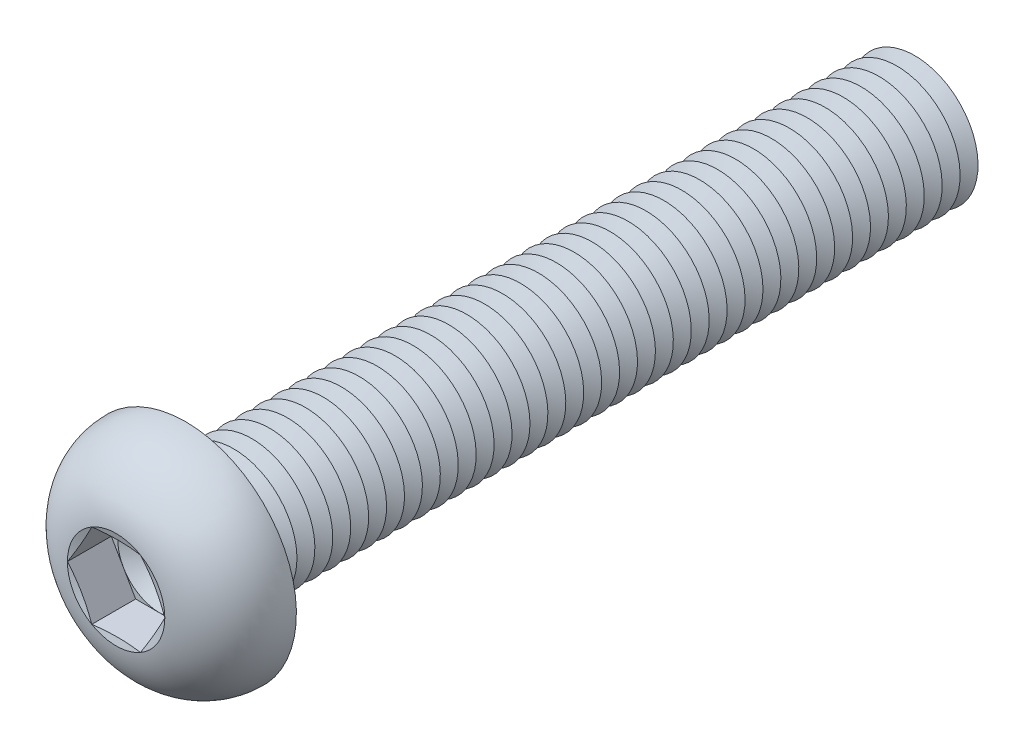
ISO-10303-21;
HEADER;
FILE_DESCRIPTION(('STEP AP214'),'2;1');
FILE_NAME('part.step','',(''),(''),'','','');
FILE_SCHEMA(('AUTOMOTIVE_DESIGN { 1 0 10303 214 1 1 1 1 }'));
ENDSEC;
DATA;
#1=APPLICATION_CONTEXT('core data for automotive mechanical design processes');
#2=APPLICATION_PROTOCOL_DEFINITION('international standard','automotive_design',2000,#1);
#3=PRODUCT_CONTEXT('',#1,'mechanical');
#4=PRODUCT('Part','Part','',(#3));
#5=PRODUCT_RELATED_PRODUCT_CATEGORY('part','',(#4));
#6=PRODUCT_DEFINITION_FORMATION('','',#4);
#7=PRODUCT_DEFINITION_CONTEXT('part definition',#1,'design');
#8=PRODUCT_DEFINITION('design','',#6,#7);
#9=PRODUCT_DEFINITION_SHAPE('','',#8);
#10=(LENGTH_UNIT() NAMED_UNIT(*) SI_UNIT(.MILLI.,.METRE.));
#11=(NAMED_UNIT(*) PLANE_ANGLE_UNIT() SI_UNIT($,.RADIAN.));
#12=(NAMED_UNIT(*) SI_UNIT($,.STERADIAN.) SOLID_ANGLE_UNIT());
#13=UNCERTAINTY_MEASURE_WITH_UNIT(LENGTH_MEASURE(1.E-05),#10,'distance_accuracy_value','');
#14=(GEOMETRIC_REPRESENTATION_CONTEXT(3) GLOBAL_UNCERTAINTY_ASSIGNED_CONTEXT((#13)) GLOBAL_UNIT_ASSIGNED_CONTEXT((#10,
#11,#12)) REPRESENTATION_CONTEXT('',''));
#15=CARTESIAN_POINT('',(0.,0.,0.));
#16=DIRECTION('',(0.,0.,1.));
#17=DIRECTION('',(1.,0.,0.));
#18=AXIS2_PLACEMENT_3D('',#15,#16,#17);
#19=CARTESIAN_POINT('',(0.,0.,2.43999999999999));
#20=DIRECTION('',(0.,0.,1.));
#21=DIRECTION('',(1.,0.,0.));
#22=AXIS2_PLACEMENT_3D('',#19,#20,#21);
#23=PLANE('',#22);
#24=CARTESIAN_POINT('',(0.,0.,2.43999999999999));
#25=DIRECTION('',(0.,0.,1.));
#26=DIRECTION('',(1.,0.,0.));
#27=AXIS2_PLACEMENT_3D('',#24,#25,#26);
#28=CIRCLE('',#27,3.99999813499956);
#29=CARTESIAN_POINT('',(3.4641,1.99999906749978,2.43999999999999));
#30=VERTEX_POINT('',#29);
#31=CARTESIAN_POINT('',(0.,3.99999813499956,2.43999999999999));
#32=VERTEX_POINT('',#31);
#33=EDGE_CURVE('E118',#30,#32,#28,.T.);
#34=ORIENTED_EDGE('',*,*,#33,.F.);
#35=DIRECTION('',(-0.5,0.866025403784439,0.));
#36=VECTOR('',#35,1.);
#37=CARTESIAN_POINT('',(4.6188,0.,2.43999999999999));
#38=LINE('',#37,#36);
#39=CARTESIAN_POINT('',(2.3094,3.99999813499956,2.43999999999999));
#40=VERTEX_POINT('',#39);
#41=EDGE_CURVE('E125',#30,#40,#38,.T.);
#42=ORIENTED_EDGE('',*,*,#41,.T.);
#43=DIRECTION('',(-1.,0.,0.));
#44=VECTOR('',#43,1.);
#45=CARTESIAN_POINT('',(2.3094,3.99999813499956,2.43999999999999));
#46=LINE('',#45,#44);
#47=EDGE_CURVE('E136',#40,#32,#46,.T.);
#48=ORIENTED_EDGE('',*,*,#47,.T.);
#49=EDGE_LOOP('',(#34,#42,#48));
#50=FACE_BOUND('',#49,.T.);
#51=ADVANCED_FACE('F39',(#50),#23,.T.);
#52=CARTESIAN_POINT('',(0.,0.,2.43999999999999));
#53=DIRECTION('',(0.,0.,1.));
#54=DIRECTION('',(1.,0.,0.));
#55=AXIS2_PLACEMENT_3D('',#52,#53,#54);
#56=CIRCLE('',#55,3.99999813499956);
#57=CARTESIAN_POINT('',(-3.4641,1.99999906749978,2.43999999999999));
#58=VERTEX_POINT('',#57);
#59=EDGE_CURVE('E11',#32,#58,#56,.T.);
#60=ORIENTED_EDGE('',*,*,#59,.F.);
#61=CARTESIAN_POINT('',(-2.3094,3.99999813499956,2.43999999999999));
#62=VERTEX_POINT('',#61);
#63=EDGE_CURVE('E131',#32,#62,#46,.T.);
#64=ORIENTED_EDGE('',*,*,#63,.T.);
#65=DIRECTION('',(-0.5,-0.866025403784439,0.));
#66=VECTOR('',#65,1.);
#67=CARTESIAN_POINT('',(-2.3094,3.99999813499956,2.43999999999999));
#68=LINE('',#67,#66);
#69=EDGE_CURVE('E134',#62,#58,#68,.T.);
#70=ORIENTED_EDGE('',*,*,#69,.T.);
#71=EDGE_LOOP('',(#60,#64,#70));
#72=FACE_BOUND('',#71,.T.);
#73=ADVANCED_FACE('F130',(#72),#23,.T.);
#74=CARTESIAN_POINT('',(-3.4641,-1.99999906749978,2.43999999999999));
#75=VERTEX_POINT('',#74);
#76=EDGE_CURVE('E49',#58,#75,#56,.T.);
#77=ORIENTED_EDGE('',*,*,#76,.F.);
#78=CARTESIAN_POINT('',(-4.6188,0.,2.43999999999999));
#79=VERTEX_POINT('',#78);
#80=EDGE_CURVE('E143',#58,#79,#68,.T.);
#81=ORIENTED_EDGE('',*,*,#80,.T.);
#82=DIRECTION('',(0.5,-0.866025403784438,0.));
#83=VECTOR('',#82,1.);
#84=CARTESIAN_POINT('',(-4.6188,0.,2.43999999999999));
#85=LINE('',#84,#83);
#86=EDGE_CURVE('E151',#79,#75,#85,.T.);
#87=ORIENTED_EDGE('',*,*,#86,.T.);
#88=EDGE_LOOP('',(#77,#81,#87));
#89=FACE_BOUND('',#88,.T.);
#90=ADVANCED_FACE('F601',(#89),#23,.T.);
#91=CARTESIAN_POINT('',(0.,-3.99999813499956,2.43999999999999));
#92=VERTEX_POINT('',#91);
#93=EDGE_CURVE('E585',#75,#92,#56,.T.);
#94=ORIENTED_EDGE('',*,*,#93,.F.);
#95=CARTESIAN_POINT('',(-2.3094,-3.99999813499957,2.43999999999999));
#96=VERTEX_POINT('',#95);
#97=EDGE_CURVE('E150',#75,#96,#85,.T.);
#98=ORIENTED_EDGE('',*,*,#97,.T.);
#99=DIRECTION('',(1.,0.,0.));
#100=VECTOR('',#99,1.);
#101=CARTESIAN_POINT('',(-2.3094,-3.99999813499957,2.43999999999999));
#102=LINE('',#101,#100);
#103=EDGE_CURVE('E156',#96,#92,#102,.T.);
#104=ORIENTED_EDGE('',*,*,#103,.T.);
#105=EDGE_LOOP('',(#94,#98,#104));
#106=FACE_BOUND('',#105,.T.);
#107=ADVANCED_FACE('F594',(#106),#23,.T.);
#108=CARTESIAN_POINT('',(3.4641,-1.99999906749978,2.43999999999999));
#109=VERTEX_POINT('',#108);
#110=EDGE_CURVE('E56',#92,#109,#56,.T.);
#111=ORIENTED_EDGE('',*,*,#110,.F.);
#112=CARTESIAN_POINT('',(2.3094,-3.99999813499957,2.43999999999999));
#113=VERTEX_POINT('',#112);
#114=EDGE_CURVE('E155',#92,#113,#102,.T.);
#115=ORIENTED_EDGE('',*,*,#114,.T.);
#116=DIRECTION('',(0.5,0.866025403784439,0.));
#117=VECTOR('',#116,1.);
#118=CARTESIAN_POINT('',(2.3094,-3.99999813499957,2.43999999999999));
#119=LINE('',#118,#117);
#120=EDGE_CURVE('E161',#113,#109,#119,.T.);
#121=ORIENTED_EDGE('',*,*,#120,.T.);
#122=EDGE_LOOP('',(#111,#115,#121));
#123=FACE_BOUND('',#122,.T.);
#124=ADVANCED_FACE('F670',(#123),#23,.T.);
#125=CARTESIAN_POINT('',(0.,0.,6.59999999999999));
#126=DIRECTION('',(0.,0.,1.));
#127=DIRECTION('',(0.,-1.,0.));
#128=AXIS2_PLACEMENT_3D('',#125,#126,#127);
#129=CONICAL_SURFACE('',#128,4.6188,1.30899693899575);
#130=CARTESIAN_POINT('',(4.61891547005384,-0.000200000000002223,6.6000309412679));
#131=CARTESIAN_POINT('',(4.52300232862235,0.165926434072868,6.57431944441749));
#132=CARTESIAN_POINT('',(4.42691527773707,0.332354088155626,6.55097758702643));
#133=CARTESIAN_POINT('',(4.23440181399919,0.665797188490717,6.50996805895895));
#134=CARTESIAN_POINT('',(4.13797527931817,0.832812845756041,6.49230269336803));
#135=CARTESIAN_POINT('',(3.94536752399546,1.16641926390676,6.46367750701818));
#136=CARTESIAN_POINT('',(3.84918760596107,1.33300776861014,6.45268354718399));
#137=CARTESIAN_POINT('',(3.65670510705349,1.66639723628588,6.4379417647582));
#138=CARTESIAN_POINT('',(3.56040255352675,1.83319815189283,6.43419253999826));
#139=CARTESIAN_POINT('',(3.36779744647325,2.16679998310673,6.43419253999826));
#140=CARTESIAN_POINT('',(3.2714948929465,2.33360089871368,6.4379417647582));
#141=CARTESIAN_POINT('',(3.07901239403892,2.66699036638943,6.45268354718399));
#142=CARTESIAN_POINT('',(2.98283247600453,2.8335788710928,6.46367750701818));
#143=CARTESIAN_POINT('',(2.79022472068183,3.16718528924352,6.49230269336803));
#144=CARTESIAN_POINT('',(2.69379818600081,3.33420094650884,6.50996805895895));
#145=CARTESIAN_POINT('',(2.50128472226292,3.66764404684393,6.55097758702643));
#146=CARTESIAN_POINT('',(2.40519767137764,3.83407170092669,6.57431944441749));
#147=CARTESIAN_POINT('',(2.30928452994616,4.00019813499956,6.6000309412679));
#148=B_SPLINE_CURVE_WITH_KNOTS('',3,(#130,#131,#132,#133,#134,#135,#136,#137,#138,#139,#140,
#141,#142,#143,#144,#145,#146,#147),.UNSPECIFIED.,.F.,.F.,(4,2,2,2,2,2,2,2,4),(0.,
0.580655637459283,1.16154676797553,1.73943971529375,2.31722080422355,2.89500189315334,
3.47289484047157,4.05378597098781,4.63444160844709),.UNSPECIFIED.);
#149=CARTESIAN_POINT('',(4.6188,0.,6.59999999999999));
#150=VERTEX_POINT('',#149);
#151=CARTESIAN_POINT('',(2.30940000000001,3.99999813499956,6.6));
#152=VERTEX_POINT('',#151);
#153=EDGE_CURVE('E220',#150,#152,#148,.T.);
#154=ORIENTED_EDGE('',*,*,#153,.F.);
#155=CARTESIAN_POINT('',(0.,0.,6.59999999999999));
#156=DIRECTION('',(0.,0.,-1.));
#157=DIRECTION('',(0.,1.,0.));
#158=AXIS2_PLACEMENT_3D('',#155,#156,#157);
#159=CIRCLE('',#158,4.6188);
#160=EDGE_CURVE('E564',#152,#150,#159,.T.);
#161=ORIENTED_EDGE('',*,*,#160,.F.);
#162=EDGE_LOOP('',(#154,#161));
#163=FACE_BOUND('',#162,.T.);
#164=ADVANCED_FACE('F674',(#163),#129,.F.);
#165=CARTESIAN_POINT('',(2.30928452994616,-4.00019813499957,6.6000309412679));
#166=CARTESIAN_POINT('',(2.40519767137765,-3.8340717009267,6.57431944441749));
#167=CARTESIAN_POINT('',(2.50128472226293,-3.66764404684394,6.55097758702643));
#168=CARTESIAN_POINT('',(2.69379818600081,-3.33420094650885,6.50996805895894));
#169=CARTESIAN_POINT('',(2.79022472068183,-3.16718528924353,6.49230269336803));
#170=CARTESIAN_POINT('',(2.98283247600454,-2.8335788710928,6.46367750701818));
#171=CARTESIAN_POINT('',(3.07901239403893,-2.66699036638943,6.45268354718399));
#172=CARTESIAN_POINT('',(3.2714948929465,-2.33360089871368,6.4379417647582));
#173=CARTESIAN_POINT('',(3.36779744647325,-2.16679998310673,6.43419253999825));
#174=CARTESIAN_POINT('',(3.56040255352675,-1.83319815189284,6.43419253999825));
#175=CARTESIAN_POINT('',(3.6567051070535,-1.66639723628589,6.4379417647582));
#176=CARTESIAN_POINT('',(3.84918760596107,-1.33300776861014,6.45268354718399));
#177=CARTESIAN_POINT('',(3.94536752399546,-1.16641926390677,6.46367750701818));
#178=CARTESIAN_POINT('',(4.13797527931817,-0.832812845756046,6.49230269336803));
#179=CARTESIAN_POINT('',(4.23440181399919,-0.665797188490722,6.50996805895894));
#180=CARTESIAN_POINT('',(4.42691527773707,-0.332354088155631,6.55097758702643));
#181=CARTESIAN_POINT('',(4.52300232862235,-0.165926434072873,6.57431944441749));
#182=CARTESIAN_POINT('',(4.61891547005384,0.000199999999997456,6.6000309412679));
#183=B_SPLINE_CURVE_WITH_KNOTS('',3,(#165,#166,#167,#168,#169,#170,#171,#172,#173,#174,#175,
#176,#177,#178,#179,#180,#181,#182),.UNSPECIFIED.,.F.,.F.,(4,2,2,2,2,2,2,2,4),(0.,
0.580655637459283,1.16154676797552,1.73943971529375,2.31722080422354,2.89500189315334,
3.47289484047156,4.05378597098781,4.63444160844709),.UNSPECIFIED.);
#184=CARTESIAN_POINT('',(2.3094,-3.99999813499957,6.59999999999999));
#185=VERTEX_POINT('',#184);
#186=EDGE_CURVE('E229',#185,#150,#183,.T.);
#187=ORIENTED_EDGE('',*,*,#186,.F.);
#188=EDGE_CURVE('E569',#150,#185,#159,.T.);
#189=ORIENTED_EDGE('',*,*,#188,.F.);
#190=EDGE_LOOP('',(#187,#189));
#191=FACE_BOUND('',#190,.T.);
#192=ADVANCED_FACE('F636',(#191),#129,.F.);
#193=CARTESIAN_POINT('',(-6.96966750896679,-3.99999813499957,7.51561854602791));
#194=CARTESIAN_POINT('',(-6.80094634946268,-3.99999813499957,7.4764117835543));
#195=CARTESIAN_POINT('',(-6.63214895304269,-3.99999813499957,7.43753277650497));
#196=CARTESIAN_POINT('',(-6.29436999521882,-3.99999813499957,7.36057075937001));
#197=CARTESIAN_POINT('',(-6.12538843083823,-3.99999813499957,7.32248776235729));
#198=CARTESIAN_POINT('',(-5.61806276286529,-3.99999813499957,7.20963087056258));
#199=CARTESIAN_POINT('',(-5.27940301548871,-3.99999813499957,7.1362643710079));
#200=CARTESIAN_POINT('',(-4.5977576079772,-3.99999813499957,6.99431141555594));
#201=CARTESIAN_POINT('',(-4.25476115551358,-3.99999813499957,6.92577621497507));
#202=CARTESIAN_POINT('',(-3.56716783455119,-3.99999813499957,6.79696563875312));
#203=CARTESIAN_POINT('',(-3.22257082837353,-3.99999813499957,6.73669098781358));
#204=CARTESIAN_POINT('',(-2.54069952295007,-3.99999813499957,6.63002020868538));
#205=CARTESIAN_POINT('',(-2.20347918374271,-3.99999813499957,6.58329286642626));
#206=CARTESIAN_POINT('',(-1.6962445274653,-3.99999813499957,6.52585827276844));
#207=CARTESIAN_POINT('',(-1.52694760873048,-3.99999813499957,6.50882377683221));
#208=CARTESIAN_POINT('',(-1.187938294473,-3.99999813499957,6.47963274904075));
#209=CARTESIAN_POINT('',(-1.01822592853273,-3.99999813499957,6.4674758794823));
#210=CARTESIAN_POINT('',(-0.679233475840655,-3.99999813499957,6.44863176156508));
#211=CARTESIAN_POINT('',(-0.509954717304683,-3.99999813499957,6.44192096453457));
#212=CARTESIAN_POINT('',(-0.171265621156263,-3.99999813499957,6.43422163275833));
#213=CARTESIAN_POINT('',(-0.00185528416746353,-3.99999813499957,6.43323307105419));
#214=CARTESIAN_POINT('',(0.336912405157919,-3.99999813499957,6.43703123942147));
#215=CARTESIAN_POINT('',(0.506269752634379,-3.99999813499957,6.44181839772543));
#216=CARTESIAN_POINT('',(0.844732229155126,-3.99999813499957,6.45691823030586));
#217=CARTESIAN_POINT('',(1.01383735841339,-3.99999813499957,6.46723089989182));
#218=CARTESIAN_POINT('',(1.42449950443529,-3.99999813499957,6.49843349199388));
#219=CARTESIAN_POINT('',(1.66585565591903,-3.99999813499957,6.52196685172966));
#220=CARTESIAN_POINT('',(2.14755410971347,-3.99999813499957,6.57749710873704));
#221=CARTESIAN_POINT('',(2.3878964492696,-3.99999813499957,6.60949369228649));
#222=CARTESIAN_POINT('',(2.86835569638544,-3.99999813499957,6.68017769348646));
#223=CARTESIAN_POINT('',(3.10846949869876,-3.99999813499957,6.71888590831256));
#224=CARTESIAN_POINT('',(3.5878341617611,-3.99999813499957,6.80132981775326));
#225=CARTESIAN_POINT('',(3.82708497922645,-3.99999813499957,6.84506576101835));
#226=CARTESIAN_POINT('',(4.30977392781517,-3.99999813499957,6.93726543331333));
#227=CARTESIAN_POINT('',(4.55319689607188,-3.99999813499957,6.98580793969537));
#228=CARTESIAN_POINT('',(5.03943022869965,-3.99999813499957,7.085866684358));
#229=CARTESIAN_POINT('',(5.28224058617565,-3.99999813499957,7.13738295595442));
#230=CARTESIAN_POINT('',(5.76604885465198,-3.99999813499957,7.24238429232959));
#231=CARTESIAN_POINT('',(6.00704943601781,-3.99999813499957,7.29585711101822));
#232=CARTESIAN_POINT('',(6.48863948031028,-3.99999813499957,7.40454827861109));
#233=CARTESIAN_POINT('',(6.72922897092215,-3.99999813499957,7.45976650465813));
#234=CARTESIAN_POINT('',(6.9696675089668,-3.99999813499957,7.51561854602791));
#235=B_SPLINE_CURVE_WITH_KNOTS('',3,(#193,#194,#195,#196,#197,#198,#199,#200,#201,#202,#203,
#204,#205,#206,#207,#208,#209,#210,#211,#212,#213,#214,#215,#216,#217,#218,#219,#220,#221,#222,
#223,#224,#225,#226,#227,#228,#229,#230,#231,#232,#233,#234),.UNSPECIFIED.,.F.,.F.,(4,2,2,2,2,2,
2,2,2,2,2,2,2,2,2,2,2,2,2,2,4),(0.,0.519649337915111,1.03930720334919,2.07882421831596,
3.1280857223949,4.17743921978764,5.19841727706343,5.7088142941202,6.21917596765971,
6.72731891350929,7.23545946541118,7.74363769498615,8.25181549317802,8.97911831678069,
9.70639418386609,10.4359652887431,11.1655724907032,11.910195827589,12.6548275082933,
13.395405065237,14.1359306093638),.UNSPECIFIED.);
#236=CARTESIAN_POINT('',(-2.3094,-3.99999813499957,6.59999999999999));
#237=VERTEX_POINT('',#236);
#238=EDGE_CURVE('E615',#237,#185,#235,.T.);
#239=ORIENTED_EDGE('',*,*,#238,.F.);
#240=EDGE_CURVE('E628',#185,#237,#159,.T.);
#241=ORIENTED_EDGE('',*,*,#240,.F.);
#242=EDGE_LOOP('',(#239,#241));
#243=FACE_BOUND('',#242,.T.);
#244=ADVANCED_FACE('F641',(#243),#129,.F.);
#245=CARTESIAN_POINT('',(-4.61891547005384,0.000199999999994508,6.6000309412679));
#246=CARTESIAN_POINT('',(-4.52300232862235,-0.165926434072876,6.57431944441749));
#247=CARTESIAN_POINT('',(-4.42691527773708,-0.332354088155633,6.55097758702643));
#248=CARTESIAN_POINT('',(-4.23440181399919,-0.665797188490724,6.50996805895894));
#249=CARTESIAN_POINT('',(-4.13797527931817,-0.832812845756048,6.49230269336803));
#250=CARTESIAN_POINT('',(-3.94536752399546,-1.16641926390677,6.46367750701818));
#251=CARTESIAN_POINT('',(-3.84918760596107,-1.33300776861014,6.45268354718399));
#252=CARTESIAN_POINT('',(-3.6567051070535,-1.66639723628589,6.4379417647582));
#253=CARTESIAN_POINT('',(-3.56040255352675,-1.83319815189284,6.43419253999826));
#254=CARTESIAN_POINT('',(-3.36779744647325,-2.16679998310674,6.43419253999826));
#255=CARTESIAN_POINT('',(-3.2714948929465,-2.33360089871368,6.4379417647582));
#256=CARTESIAN_POINT('',(-3.07901239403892,-2.66699036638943,6.45268354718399));
#257=CARTESIAN_POINT('',(-2.98283247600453,-2.83357887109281,6.46367750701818));
#258=CARTESIAN_POINT('',(-2.79022472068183,-3.16718528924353,6.49230269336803));
#259=CARTESIAN_POINT('',(-2.69379818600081,-3.33420094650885,6.50996805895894));
#260=CARTESIAN_POINT('',(-2.50128472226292,-3.66764404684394,6.55097758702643));
#261=CARTESIAN_POINT('',(-2.40519767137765,-3.8340717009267,6.57431944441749));
#262=CARTESIAN_POINT('',(-2.30928452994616,-4.00019813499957,6.60003094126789));
#263=B_SPLINE_CURVE_WITH_KNOTS('',3,(#245,#246,#247,#248,#249,#250,#251,#252,#253,#254,#255,
#256,#257,#258,#259,#260,#261,#262),.UNSPECIFIED.,.F.,.F.,(4,2,2,2,2,2,2,2,4),(0.,
0.580655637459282,1.16154676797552,1.73943971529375,2.31722080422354,2.89500189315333,
3.47289484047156,4.05378597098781,4.63444160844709),.UNSPECIFIED.);
#264=CARTESIAN_POINT('',(-4.6188,0.,6.59999999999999));
#265=VERTEX_POINT('',#264);
#266=EDGE_CURVE('E606',#265,#237,#263,.T.);
#267=ORIENTED_EDGE('',*,*,#266,.F.);
#268=EDGE_CURVE('E612',#237,#265,#159,.T.);
#269=ORIENTED_EDGE('',*,*,#268,.F.);
#270=EDGE_LOOP('',(#267,#269));
#271=FACE_BOUND('',#270,.T.);
#272=ADVANCED_FACE('F610',(#271),#129,.F.);
#273=CARTESIAN_POINT('',(-2.30928452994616,4.00019813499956,6.6000309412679));
#274=CARTESIAN_POINT('',(-2.40519767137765,3.83407170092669,6.57431944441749));
#275=CARTESIAN_POINT('',(-2.50128472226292,3.66764404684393,6.55097758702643));
#276=CARTESIAN_POINT('',(-2.69379818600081,3.33420094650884,6.50996805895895));
#277=CARTESIAN_POINT('',(-2.79022472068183,3.16718528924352,6.49230269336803));
#278=CARTESIAN_POINT('',(-2.98283247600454,2.8335788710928,6.46367750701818));
#279=CARTESIAN_POINT('',(-3.07901239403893,2.66699036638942,6.45268354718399));
#280=CARTESIAN_POINT('',(-3.2714948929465,2.33360089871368,6.4379417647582));
#281=CARTESIAN_POINT('',(-3.36779744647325,2.16679998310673,6.43419253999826));
#282=CARTESIAN_POINT('',(-3.56040255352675,1.83319815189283,6.43419253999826));
#283=CARTESIAN_POINT('',(-3.6567051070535,1.66639723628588,6.4379417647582));
#284=CARTESIAN_POINT('',(-3.84918760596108,1.33300776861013,6.45268354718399));
#285=CARTESIAN_POINT('',(-3.94536752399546,1.16641926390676,6.46367750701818));
#286=CARTESIAN_POINT('',(-4.13797527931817,0.832812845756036,6.49230269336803));
#287=CARTESIAN_POINT('',(-4.23440181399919,0.665797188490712,6.50996805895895));
#288=CARTESIAN_POINT('',(-4.42691527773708,0.332354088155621,6.55097758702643));
#289=CARTESIAN_POINT('',(-4.52300232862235,0.165926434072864,6.57431944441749));
#290=CARTESIAN_POINT('',(-4.61891547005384,-0.000200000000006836,6.6000309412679));
#291=B_SPLINE_CURVE_WITH_KNOTS('',3,(#273,#274,#275,#276,#277,#278,#279,#280,#281,#282,#283,
#284,#285,#286,#287,#288,#289,#290),.UNSPECIFIED.,.F.,.F.,(4,2,2,2,2,2,2,2,4),(0.,
0.580655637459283,1.16154676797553,1.73943971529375,2.31722080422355,2.89500189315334,
3.47289484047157,4.05378597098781,4.63444160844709),.UNSPECIFIED.);
#292=CARTESIAN_POINT('',(-2.3094,3.99999813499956,6.59999999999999));
#293=VERTEX_POINT('',#292);
#294=EDGE_CURVE('E193',#293,#265,#291,.T.);
#295=ORIENTED_EDGE('',*,*,#294,.F.);
#296=EDGE_CURVE('E618',#265,#293,#159,.T.);
#297=ORIENTED_EDGE('',*,*,#296,.F.);
#298=EDGE_LOOP('',(#295,#297));
#299=FACE_BOUND('',#298,.T.);
#300=ADVANCED_FACE('F619',(#299),#129,.F.);
#301=CARTESIAN_POINT('',(0.,0.,-64.05));
#302=DIRECTION('',(0.,0.,1.));
#303=DIRECTION('',(0.,-1.,0.));
#304=AXIS2_PLACEMENT_3D('',#301,#302,#303);
#305=CONICAL_SURFACE('',#304,5.99999999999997,1.0471975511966);
#306=CARTESIAN_POINT('',(0.,0.,-64.9));
#307=DIRECTION('',(0.,0.,1.));
#308=DIRECTION('',(0.,-1.,0.));
#309=AXIS2_PLACEMENT_3D('',#306,#307,#308);
#310=CIRCLE('',#309,4.52775681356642);
#311=CARTESIAN_POINT('',(0.,-4.52775681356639,-64.9));
#312=VERTEX_POINT('',#311);
#313=EDGE_CURVE('E535',#312,#312,#310,.T.);
#314=ORIENTED_EDGE('',*,*,#313,.T.);
#315=EDGE_LOOP('',(#314));
#316=FACE_BOUND('',#315,.T.);
#317=CARTESIAN_POINT('',(0.,0.,-64.05));
#318=DIRECTION('',(0.,0.,1.));
#319=DIRECTION('',(0.,-1.,0.));
#320=AXIS2_PLACEMENT_3D('',#317,#318,#319);
#321=CIRCLE('',#320,5.99999999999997);
#322=CARTESIAN_POINT('',(0.,-5.99999999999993,-64.05));
#323=VERTEX_POINT('',#322);
#324=EDGE_CURVE('E531',#323,#323,#321,.T.);
#325=ORIENTED_EDGE('',*,*,#324,.F.);
#326=EDGE_LOOP('',(#325));
#327=FACE_BOUND('',#326,.T.);
#328=ADVANCED_FACE('F697',(#316,#327),#305,.T.);
#329=CARTESIAN_POINT('',(0.,0.,-64.9));
#330=DIRECTION('',(0.,0.,-1.));
#331=DIRECTION('',(0.,1.,0.));
#332=AXIS2_PLACEMENT_3D('',#329,#330,#331);
#333=CONICAL_SURFACE('',#332,4.52775681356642,1.0471975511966);
#334=CARTESIAN_POINT('',(0.,0.,-65.75));
#335=DIRECTION('',(0.,0.,1.));
#336=DIRECTION('',(0.,-1.,0.));
#337=AXIS2_PLACEMENT_3D('',#334,#335,#336);
#338=CIRCLE('',#337,5.99999999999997);
#339=CARTESIAN_POINT('',(0.,-5.99999999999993,-65.75));
#340=VERTEX_POINT('',#339);
#341=EDGE_CURVE('E539',#340,#340,#338,.T.);
#342=ORIENTED_EDGE('',*,*,#341,.T.);
#343=EDGE_LOOP('',(#342));
#344=FACE_BOUND('',#343,.T.);
#345=ORIENTED_EDGE('',*,*,#313,.F.);
#346=EDGE_LOOP('',(#345));
#347=FACE_BOUND('',#346,.T.);
#348=ADVANCED_FACE('F702',(#344,#347),#333,.T.);
#349=CARTESIAN_POINT('',(0.,5.99999999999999,-70.));
#350=DIRECTION('',(0.,0.,-1.));
#351=DIRECTION('',(0.,1.,0.));
#352=AXIS2_PLACEMENT_3D('',#349,#350,#351);
#353=PLANE('',#352);
#354=CARTESIAN_POINT('',(0.,0.,-70.));
#355=DIRECTION('',(0.,0.,1.));
#356=DIRECTION('',(0.,-1.,0.));
#357=AXIS2_PLACEMENT_3D('',#354,#355,#356);
#358=CIRCLE('',#357,4.52775681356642);
#359=CARTESIAN_POINT('',(0.,-4.52775681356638,-70.));
#360=VERTEX_POINT('',#359);
#361=EDGE_CURVE('E559',#360,#360,#358,.T.);
#362=ORIENTED_EDGE('',*,*,#361,.F.);
#363=EDGE_LOOP('',(#362));
#364=FACE_BOUND('',#363,.T.);
#365=ADVANCED_FACE('F877',(#364),#353,.T.);
#366=CARTESIAN_POINT('',(0.,0.,-69.15));
#367=DIRECTION('',(0.,0.,1.));
#368=DIRECTION('',(0.,-1.,0.));
#369=AXIS2_PLACEMENT_3D('',#366,#367,#368);
#370=CONICAL_SURFACE('',#369,5.99999999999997,1.0471975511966);
#371=ORIENTED_EDGE('',*,*,#361,.T.);
#372=EDGE_LOOP('',(#371));
#373=FACE_BOUND('',#372,.T.);
#374=CARTESIAN_POINT('',(0.,0.,-69.15));
#375=DIRECTION('',(0.,0.,1.));
#376=DIRECTION('',(0.,-1.,0.));
#377=AXIS2_PLACEMENT_3D('',#374,#375,#376);
#378=CIRCLE('',#377,5.99999999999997);
#379=CARTESIAN_POINT('',(0.,-5.99999999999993,-69.15));
#380=VERTEX_POINT('',#379);
#381=EDGE_CURVE('E555',#380,#380,#378,.T.);
#382=ORIENTED_EDGE('',*,*,#381,.F.);
#383=EDGE_LOOP('',(#382));
#384=FACE_BOUND('',#383,.T.);
#385=ADVANCED_FACE('F870',(#373,#384),#370,.T.);
#386=CARTESIAN_POINT('',(0.,0.,-68.3));
#387=DIRECTION('',(0.,0.,-1.));
#388=DIRECTION('',(0.,1.,0.));
#389=AXIS2_PLACEMENT_3D('',#386,#387,#388);
#390=CONICAL_SURFACE('',#389,4.52775681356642,1.0471975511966);
#391=ORIENTED_EDGE('',*,*,#381,.T.);
#392=EDGE_LOOP('',(#391));
#393=FACE_BOUND('',#392,.T.);
#394=CARTESIAN_POINT('',(0.,0.,-68.3));
#395=DIRECTION('',(0.,0.,1.));
#396=DIRECTION('',(0.,-1.,0.));
#397=AXIS2_PLACEMENT_3D('',#394,#395,#396);
#398=CIRCLE('',#397,4.52775681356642);
#399=CARTESIAN_POINT('',(0.,-4.52775681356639,-68.3));
#400=VERTEX_POINT('',#399);
#401=EDGE_CURVE('E551',#400,#400,#398,.T.);
#402=ORIENTED_EDGE('',*,*,#401,.F.);
#403=EDGE_LOOP('',(#402));
#404=FACE_BOUND('',#403,.T.);
#405=ADVANCED_FACE('F876',(#393,#404),#390,.T.);
#406=CARTESIAN_POINT('',(0.,0.,-67.45));
#407=DIRECTION('',(0.,0.,1.));
#408=DIRECTION('',(0.,-1.,0.));
#409=AXIS2_PLACEMENT_3D('',#406,#407,#408);
#410=CONICAL_SURFACE('',#409,5.99999999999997,1.0471975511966);
#411=ORIENTED_EDGE('',*,*,#401,.T.);
#412=EDGE_LOOP('',(#411));
#413=FACE_BOUND('',#412,.T.);
#414=CARTESIAN_POINT('',(0.,0.,-67.45));
#415=DIRECTION('',(0.,0.,1.));
#416=DIRECTION('',(0.,-1.,0.));
#417=AXIS2_PLACEMENT_3D('',#414,#415,#416);
#418=CIRCLE('',#417,5.99999999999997);
#419=CARTESIAN_POINT('',(0.,-5.99999999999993,-67.45));
#420=VERTEX_POINT('',#419);
#421=EDGE_CURVE('E547',#420,#420,#418,.T.);
#422=ORIENTED_EDGE('',*,*,#421,.F.);
#423=EDGE_LOOP('',(#422));
#424=FACE_BOUND('',#423,.T.);
#425=ADVANCED_FACE('F908',(#413,#424),#410,.T.);
#426=CARTESIAN_POINT('',(0.,0.,-66.6));
#427=DIRECTION('',(0.,0.,-1.));
#428=DIRECTION('',(0.,1.,0.));
#429=AXIS2_PLACEMENT_3D('',#426,#427,#428);
#430=CONICAL_SURFACE('',#429,4.52775681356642,1.0471975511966);
#431=ORIENTED_EDGE('',*,*,#421,.T.);
#432=EDGE_LOOP('',(#431));
#433=FACE_BOUND('',#432,.T.);
#434=CARTESIAN_POINT('',(0.,0.,-66.6));
#435=DIRECTION('',(0.,0.,1.));
#436=DIRECTION('',(0.,-1.,0.));
#437=AXIS2_PLACEMENT_3D('',#434,#435,#436);
#438=CIRCLE('',#437,4.52775681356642);
#439=CARTESIAN_POINT('',(0.,-4.52775681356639,-66.6));
#440=VERTEX_POINT('',#439);
#441=EDGE_CURVE('E543',#440,#440,#438,.T.);
#442=ORIENTED_EDGE('',*,*,#441,.F.);
#443=EDGE_LOOP('',(#442));
#444=FACE_BOUND('',#443,.T.);
#445=ADVANCED_FACE('F918',(#433,#444),#430,.T.);
#446=CARTESIAN_POINT('',(0.,0.,-65.75));
#447=DIRECTION('',(0.,0.,1.));
#448=DIRECTION('',(0.,-1.,0.));
#449=AXIS2_PLACEMENT_3D('',#446,#447,#448);
#450=CONICAL_SURFACE('',#449,5.99999999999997,1.0471975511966);
#451=ORIENTED_EDGE('',*,*,#441,.T.);
#452=EDGE_LOOP('',(#451));
#453=FACE_BOUND('',#452,.T.);
#454=ORIENTED_EDGE('',*,*,#341,.F.);
#455=EDGE_LOOP('',(#454));
#456=FACE_BOUND('',#455,.T.);
#457=ADVANCED_FACE('F928',(#453,#456),#450,.T.);
#458=CARTESIAN_POINT('',(0.,0.,-62.35));
#459=DIRECTION('',(0.,0.,1.));
#460=DIRECTION('',(0.,-1.,0.));
#461=AXIS2_PLACEMENT_3D('',#458,#459,#460);
#462=CONICAL_SURFACE('',#461,5.99999999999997,1.0471975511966);
#463=CARTESIAN_POINT('',(0.,0.,-63.2));
#464=DIRECTION('',(0.,0.,1.));
#465=DIRECTION('',(0.,-1.,0.));
#466=AXIS2_PLACEMENT_3D('',#463,#464,#465);
#467=CIRCLE('',#466,4.52775681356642);
#468=CARTESIAN_POINT('',(0.,-4.52775681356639,-63.2));
#469=VERTEX_POINT('',#468);
#470=EDGE_CURVE('E527',#469,#469,#467,.T.);
#471=ORIENTED_EDGE('',*,*,#470,.T.);
#472=EDGE_LOOP('',(#471));
#473=FACE_BOUND('',#472,.T.);
#474=CARTESIAN_POINT('',(0.,0.,-62.35));
#475=DIRECTION('',(0.,0.,1.));
#476=DIRECTION('',(0.,-1.,0.));
#477=AXIS2_PLACEMENT_3D('',#474,#475,#476);
#478=CIRCLE('',#477,5.99999999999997);
#479=CARTESIAN_POINT('',(0.,-5.99999999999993,-62.35));
#480=VERTEX_POINT('',#479);
#481=EDGE_CURVE('E523',#480,#480,#478,.T.);
#482=ORIENTED_EDGE('',*,*,#481,.F.);
#483=EDGE_LOOP('',(#482));
#484=FACE_BOUND('',#483,.T.);
#485=ADVANCED_FACE('F938',(#473,#484),#462,.T.);
#486=CARTESIAN_POINT('',(0.,0.,-63.2));
#487=DIRECTION('',(0.,0.,-1.));
#488=DIRECTION('',(0.,1.,0.));
#489=AXIS2_PLACEMENT_3D('',#486,#487,#488);
#490=CONICAL_SURFACE('',#489,4.52775681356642,1.0471975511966);
#491=ORIENTED_EDGE('',*,*,#324,.T.);
#492=EDGE_LOOP('',(#491));
#493=FACE_BOUND('',#492,.T.);
#494=ORIENTED_EDGE('',*,*,#470,.F.);
#495=EDGE_LOOP('',(#494));
#496=FACE_BOUND('',#495,.T.);
#497=ADVANCED_FACE('F948',(#493,#496),#490,.T.);
#498=CARTESIAN_POINT('',(0.,0.,-60.65));
#499=DIRECTION('',(0.,0.,1.));
#500=DIRECTION('',(0.,-1.,0.));
#501=AXIS2_PLACEMENT_3D('',#498,#499,#500);
#502=CONICAL_SURFACE('',#501,5.99999999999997,1.0471975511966);
#503=CARTESIAN_POINT('',(0.,0.,-61.5));
#504=DIRECTION('',(0.,0.,1.));
#505=DIRECTION('',(0.,-1.,0.));
#506=AXIS2_PLACEMENT_3D('',#503,#504,#505);
#507=CIRCLE('',#506,4.52775681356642);
#508=CARTESIAN_POINT('',(0.,-4.52775681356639,-61.5));
#509=VERTEX_POINT('',#508);
#510=EDGE_CURVE('E519',#509,#509,#507,.T.);
#511=ORIENTED_EDGE('',*,*,#510,.T.);
#512=EDGE_LOOP('',(#511));
#513=FACE_BOUND('',#512,.T.);
#514=CARTESIAN_POINT('',(0.,0.,-60.65));
#515=DIRECTION('',(0.,0.,1.));
#516=DIRECTION('',(0.,-1.,0.));
#517=AXIS2_PLACEMENT_3D('',#514,#515,#516);
#518=CIRCLE('',#517,5.99999999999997);
#519=CARTESIAN_POINT('',(0.,-5.99999999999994,-60.65));
#520=VERTEX_POINT('',#519);
#521=EDGE_CURVE('E515',#520,#520,#518,.T.);
#522=ORIENTED_EDGE('',*,*,#521,.F.);
#523=EDGE_LOOP('',(#522));
#524=FACE_BOUND('',#523,.T.);
#525=ADVANCED_FACE('F958',(#513,#524),#502,.T.);
#526=CARTESIAN_POINT('',(0.,0.,-61.5));
#527=DIRECTION('',(0.,0.,-1.));
#528=DIRECTION('',(0.,1.,0.));
#529=AXIS2_PLACEMENT_3D('',#526,#527,#528);
#530=CONICAL_SURFACE('',#529,4.52775681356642,1.0471975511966);
#531=ORIENTED_EDGE('',*,*,#481,.T.);
#532=EDGE_LOOP('',(#531));
#533=FACE_BOUND('',#532,.T.);
#534=ORIENTED_EDGE('',*,*,#510,.F.);
#535=EDGE_LOOP('',(#534));
#536=FACE_BOUND('',#535,.T.);
#537=ADVANCED_FACE('F968',(#533,#536),#530,.T.);
#538=CARTESIAN_POINT('',(0.,0.,-58.95));
#539=DIRECTION('',(0.,0.,1.));
#540=DIRECTION('',(0.,-1.,0.));
#541=AXIS2_PLACEMENT_3D('',#538,#539,#540);
#542=CONICAL_SURFACE('',#541,5.99999999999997,1.0471975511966);
#543=CARTESIAN_POINT('',(0.,0.,-59.8));
#544=DIRECTION('',(0.,0.,1.));
#545=DIRECTION('',(0.,-1.,0.));
#546=AXIS2_PLACEMENT_3D('',#543,#544,#545);
#547=CIRCLE('',#546,4.52775681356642);
#548=CARTESIAN_POINT('',(0.,-4.52775681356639,-59.8));
#549=VERTEX_POINT('',#548);
#550=EDGE_CURVE('E511',#549,#549,#547,.T.);
#551=ORIENTED_EDGE('',*,*,#550,.T.);
#552=EDGE_LOOP('',(#551));
#553=FACE_BOUND('',#552,.T.);
#554=CARTESIAN_POINT('',(0.,0.,-58.95));
#555=DIRECTION('',(0.,0.,1.));
#556=DIRECTION('',(0.,-1.,0.));
#557=AXIS2_PLACEMENT_3D('',#554,#555,#556);
#558=CIRCLE('',#557,5.99999999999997);
#559=CARTESIAN_POINT('',(0.,-5.99999999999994,-58.95));
#560=VERTEX_POINT('',#559);
#561=EDGE_CURVE('E507',#560,#560,#558,.T.);
#562=ORIENTED_EDGE('',*,*,#561,.F.);
#563=EDGE_LOOP('',(#562));
#564=FACE_BOUND('',#563,.T.);
#565=ADVANCED_FACE('F978',(#553,#564),#542,.T.);
#566=CARTESIAN_POINT('',(0.,0.,-59.8));
#567=DIRECTION('',(0.,0.,-1.));
#568=DIRECTION('',(0.,1.,0.));
#569=AXIS2_PLACEMENT_3D('',#566,#567,#568);
#570=CONICAL_SURFACE('',#569,4.52775681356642,1.0471975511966);
#571=ORIENTED_EDGE('',*,*,#521,.T.);
#572=EDGE_LOOP('',(#571));
#573=FACE_BOUND('',#572,.T.);
#574=ORIENTED_EDGE('',*,*,#550,.F.);
#575=EDGE_LOOP('',(#574));
#576=FACE_BOUND('',#575,.T.);
#577=ADVANCED_FACE('F988',(#573,#576),#570,.T.);
#578=CARTESIAN_POINT('',(0.,0.,-57.25));
#579=DIRECTION('',(0.,0.,1.));
#580=DIRECTION('',(0.,-1.,0.));
#581=AXIS2_PLACEMENT_3D('',#578,#579,#580);
#582=CONICAL_SURFACE('',#581,5.99999999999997,1.0471975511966);
#583=CARTESIAN_POINT('',(0.,0.,-58.1));
#584=DIRECTION('',(0.,0.,1.));
#585=DIRECTION('',(0.,-1.,0.));
#586=AXIS2_PLACEMENT_3D('',#583,#584,#585);
#587=CIRCLE('',#586,4.52775681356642);
#588=CARTESIAN_POINT('',(0.,-4.52775681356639,-58.1));
#589=VERTEX_POINT('',#588);
#590=EDGE_CURVE('E503',#589,#589,#587,.T.);
#591=ORIENTED_EDGE('',*,*,#590,.T.);
#592=EDGE_LOOP('',(#591));
#593=FACE_BOUND('',#592,.T.);
#594=CARTESIAN_POINT('',(0.,0.,-57.25));
#595=DIRECTION('',(0.,0.,1.));
#596=DIRECTION('',(0.,-1.,0.));
#597=AXIS2_PLACEMENT_3D('',#594,#595,#596);
#598=CIRCLE('',#597,5.99999999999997);
#599=CARTESIAN_POINT('',(0.,-5.99999999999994,-57.25));
#600=VERTEX_POINT('',#599);
#601=EDGE_CURVE('E499',#600,#600,#598,.T.);
#602=ORIENTED_EDGE('',*,*,#601,.F.);
#603=EDGE_LOOP('',(#602));
#604=FACE_BOUND('',#603,.T.);
#605=ADVANCED_FACE('F998',(#593,#604),#582,.T.);
#606=CARTESIAN_POINT('',(0.,0.,-58.1));
#607=DIRECTION('',(0.,0.,-1.));
#608=DIRECTION('',(0.,1.,0.));
#609=AXIS2_PLACEMENT_3D('',#606,#607,#608);
#610=CONICAL_SURFACE('',#609,4.52775681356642,1.0471975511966);
#611=ORIENTED_EDGE('',*,*,#561,.T.);
#612=EDGE_LOOP('',(#611));
#613=FACE_BOUND('',#612,.T.);
#614=ORIENTED_EDGE('',*,*,#590,.F.);
#615=EDGE_LOOP('',(#614));
#616=FACE_BOUND('',#615,.T.);
#617=ADVANCED_FACE('F1008',(#613,#616),#610,.T.);
#618=CARTESIAN_POINT('',(0.,0.,-55.55));
#619=DIRECTION('',(0.,0.,1.));
#620=DIRECTION('',(0.,-1.,0.));
#621=AXIS2_PLACEMENT_3D('',#618,#619,#620);
#622=CONICAL_SURFACE('',#621,5.99999999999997,1.0471975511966);
#623=CARTESIAN_POINT('',(0.,0.,-56.4));
#624=DIRECTION('',(0.,0.,1.));
#625=DIRECTION('',(0.,-1.,0.));
#626=AXIS2_PLACEMENT_3D('',#623,#624,#625);
#627=CIRCLE('',#626,4.52775681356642);
#628=CARTESIAN_POINT('',(0.,-4.52775681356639,-56.4));
#629=VERTEX_POINT('',#628);
#630=EDGE_CURVE('E495',#629,#629,#627,.T.);
#631=ORIENTED_EDGE('',*,*,#630,.T.);
#632=EDGE_LOOP('',(#631));
#633=FACE_BOUND('',#632,.T.);
#634=CARTESIAN_POINT('',(0.,0.,-55.55));
#635=DIRECTION('',(0.,0.,1.));
#636=DIRECTION('',(0.,-1.,0.));
#637=AXIS2_PLACEMENT_3D('',#634,#635,#636);
#638=CIRCLE('',#637,5.99999999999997);
#639=CARTESIAN_POINT('',(0.,-5.99999999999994,-55.55));
#640=VERTEX_POINT('',#639);
#641=EDGE_CURVE('E491',#640,#640,#638,.T.);
#642=ORIENTED_EDGE('',*,*,#641,.F.);
#643=EDGE_LOOP('',(#642));
#644=FACE_BOUND('',#643,.T.);
#645=ADVANCED_FACE('F1018',(#633,#644),#622,.T.);
#646=CARTESIAN_POINT('',(0.,0.,-56.4));
#647=DIRECTION('',(0.,0.,-1.));
#648=DIRECTION('',(0.,1.,0.));
#649=AXIS2_PLACEMENT_3D('',#646,#647,#648);
#650=CONICAL_SURFACE('',#649,4.52775681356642,1.0471975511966);
#651=ORIENTED_EDGE('',*,*,#601,.T.);
#652=EDGE_LOOP('',(#651));
#653=FACE_BOUND('',#652,.T.);
#654=ORIENTED_EDGE('',*,*,#630,.F.);
#655=EDGE_LOOP('',(#654));
#656=FACE_BOUND('',#655,.T.);
#657=ADVANCED_FACE('F1028',(#653,#656),#650,.T.);
#658=CARTESIAN_POINT('',(0.,0.,-53.85));
#659=DIRECTION('',(0.,0.,1.));
#660=DIRECTION('',(0.,-1.,0.));
#661=AXIS2_PLACEMENT_3D('',#658,#659,#660);
#662=CONICAL_SURFACE('',#661,5.99999999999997,1.0471975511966);
#663=CARTESIAN_POINT('',(0.,0.,-54.7));
#664=DIRECTION('',(0.,0.,1.));
#665=DIRECTION('',(0.,-1.,0.));
#666=AXIS2_PLACEMENT_3D('',#663,#664,#665);
#667=CIRCLE('',#666,4.52775681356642);
#668=CARTESIAN_POINT('',(0.,-4.52775681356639,-54.7));
#669=VERTEX_POINT('',#668);
#670=EDGE_CURVE('E487',#669,#669,#667,.T.);
#671=ORIENTED_EDGE('',*,*,#670,.T.);
#672=EDGE_LOOP('',(#671));
#673=FACE_BOUND('',#672,.T.);
#674=CARTESIAN_POINT('',(0.,0.,-53.85));
#675=DIRECTION('',(0.,0.,1.));
#676=DIRECTION('',(0.,-1.,0.));
#677=AXIS2_PLACEMENT_3D('',#674,#675,#676);
#678=CIRCLE('',#677,5.99999999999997);
#679=CARTESIAN_POINT('',(0.,-5.99999999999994,-53.85));
#680=VERTEX_POINT('',#679);
#681=EDGE_CURVE('E483',#680,#680,#678,.T.);
#682=ORIENTED_EDGE('',*,*,#681,.F.);
#683=EDGE_LOOP('',(#682));
#684=FACE_BOUND('',#683,.T.);
#685=ADVANCED_FACE('F1038',(#673,#684),#662,.T.);
#686=CARTESIAN_POINT('',(0.,0.,-54.7));
#687=DIRECTION('',(0.,0.,-1.));
#688=DIRECTION('',(0.,1.,0.));
#689=AXIS2_PLACEMENT_3D('',#686,#687,#688);
#690=CONICAL_SURFACE('',#689,4.52775681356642,1.0471975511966);
#691=ORIENTED_EDGE('',*,*,#641,.T.);
#692=EDGE_LOOP('',(#691));
#693=FACE_BOUND('',#692,.T.);
#694=ORIENTED_EDGE('',*,*,#670,.F.);
#695=EDGE_LOOP('',(#694));
#696=FACE_BOUND('',#695,.T.);
#697=ADVANCED_FACE('F1048',(#693,#696),#690,.T.);
#698=CARTESIAN_POINT('',(0.,0.,-52.15));
#699=DIRECTION('',(0.,0.,1.));
#700=DIRECTION('',(0.,-1.,0.));
#701=AXIS2_PLACEMENT_3D('',#698,#699,#700);
#702=CONICAL_SURFACE('',#701,5.99999999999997,1.0471975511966);
#703=CARTESIAN_POINT('',(0.,0.,-53.));
#704=DIRECTION('',(0.,0.,1.));
#705=DIRECTION('',(0.,-1.,0.));
#706=AXIS2_PLACEMENT_3D('',#703,#704,#705);
#707=CIRCLE('',#706,4.52775681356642);
#708=CARTESIAN_POINT('',(0.,-4.52775681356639,-53.));
#709=VERTEX_POINT('',#708);
#710=EDGE_CURVE('E479',#709,#709,#707,.T.);
#711=ORIENTED_EDGE('',*,*,#710,.T.);
#712=EDGE_LOOP('',(#711));
#713=FACE_BOUND('',#712,.T.);
#714=CARTESIAN_POINT('',(0.,0.,-52.15));
#715=DIRECTION('',(0.,0.,1.));
#716=DIRECTION('',(0.,-1.,0.));
#717=AXIS2_PLACEMENT_3D('',#714,#715,#716);
#718=CIRCLE('',#717,5.99999999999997);
#719=CARTESIAN_POINT('',(0.,-5.99999999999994,-52.15));
#720=VERTEX_POINT('',#719);
#721=EDGE_CURVE('E475',#720,#720,#718,.T.);
#722=ORIENTED_EDGE('',*,*,#721,.F.);
#723=EDGE_LOOP('',(#722));
#724=FACE_BOUND('',#723,.T.);
#725=ADVANCED_FACE('F1058',(#713,#724),#702,.T.);
#726=CARTESIAN_POINT('',(0.,0.,-53.));
#727=DIRECTION('',(0.,0.,-1.));
#728=DIRECTION('',(0.,1.,0.));
#729=AXIS2_PLACEMENT_3D('',#726,#727,#728);
#730=CONICAL_SURFACE('',#729,4.52775681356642,1.0471975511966);
#731=ORIENTED_EDGE('',*,*,#681,.T.);
#732=EDGE_LOOP('',(#731));
#733=FACE_BOUND('',#732,.T.);
#734=ORIENTED_EDGE('',*,*,#710,.F.);
#735=EDGE_LOOP('',(#734));
#736=FACE_BOUND('',#735,.T.);
#737=ADVANCED_FACE('F1068',(#733,#736),#730,.T.);
#738=CARTESIAN_POINT('',(0.,0.,-50.45));
#739=DIRECTION('',(0.,0.,1.));
#740=DIRECTION('',(0.,-1.,0.));
#741=AXIS2_PLACEMENT_3D('',#738,#739,#740);
#742=CONICAL_SURFACE('',#741,5.99999999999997,1.0471975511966);
#743=CARTESIAN_POINT('',(0.,0.,-51.3));
#744=DIRECTION('',(0.,0.,1.));
#745=DIRECTION('',(0.,-1.,0.));
#746=AXIS2_PLACEMENT_3D('',#743,#744,#745);
#747=CIRCLE('',#746,4.52775681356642);
#748=CARTESIAN_POINT('',(0.,-4.52775681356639,-51.3));
#749=VERTEX_POINT('',#748);
#750=EDGE_CURVE('E471',#749,#749,#747,.T.);
#751=ORIENTED_EDGE('',*,*,#750,.T.);
#752=EDGE_LOOP('',(#751));
#753=FACE_BOUND('',#752,.T.);
#754=CARTESIAN_POINT('',(0.,0.,-50.45));
#755=DIRECTION('',(0.,0.,1.));
#756=DIRECTION('',(0.,-1.,0.));
#757=AXIS2_PLACEMENT_3D('',#754,#755,#756);
#758=CIRCLE('',#757,5.99999999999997);
#759=CARTESIAN_POINT('',(0.,-5.99999999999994,-50.45));
#760=VERTEX_POINT('',#759);
#761=EDGE_CURVE('E467',#760,#760,#758,.T.);
#762=ORIENTED_EDGE('',*,*,#761,.F.);
#763=EDGE_LOOP('',(#762));
#764=FACE_BOUND('',#763,.T.);
#765=ADVANCED_FACE('F1078',(#753,#764),#742,.T.);
#766=CARTESIAN_POINT('',(0.,0.,-51.3));
#767=DIRECTION('',(0.,0.,-1.));
#768=DIRECTION('',(0.,1.,0.));
#769=AXIS2_PLACEMENT_3D('',#766,#767,#768);
#770=CONICAL_SURFACE('',#769,4.52775681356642,1.0471975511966);
#771=ORIENTED_EDGE('',*,*,#721,.T.);
#772=EDGE_LOOP('',(#771));
#773=FACE_BOUND('',#772,.T.);
#774=ORIENTED_EDGE('',*,*,#750,.F.);
#775=EDGE_LOOP('',(#774));
#776=FACE_BOUND('',#775,.T.);
#777=ADVANCED_FACE('F1088',(#773,#776),#770,.T.);
#778=CARTESIAN_POINT('',(0.,0.,-48.75));
#779=DIRECTION('',(0.,0.,1.));
#780=DIRECTION('',(0.,-1.,0.));
#781=AXIS2_PLACEMENT_3D('',#778,#779,#780);
#782=CONICAL_SURFACE('',#781,5.99999999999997,1.0471975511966);
#783=CARTESIAN_POINT('',(0.,0.,-49.6));
#784=DIRECTION('',(0.,0.,1.));
#785=DIRECTION('',(0.,-1.,0.));
#786=AXIS2_PLACEMENT_3D('',#783,#784,#785);
#787=CIRCLE('',#786,4.52775681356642);
#788=CARTESIAN_POINT('',(0.,-4.52775681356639,-49.6));
#789=VERTEX_POINT('',#788);
#790=EDGE_CURVE('E463',#789,#789,#787,.T.);
#791=ORIENTED_EDGE('',*,*,#790,.T.);
#792=EDGE_LOOP('',(#791));
#793=FACE_BOUND('',#792,.T.);
#794=CARTESIAN_POINT('',(0.,0.,-48.75));
#795=DIRECTION('',(0.,0.,1.));
#796=DIRECTION('',(0.,-1.,0.));
#797=AXIS2_PLACEMENT_3D('',#794,#795,#796);
#798=CIRCLE('',#797,5.99999999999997);
#799=CARTESIAN_POINT('',(0.,-5.99999999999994,-48.75));
#800=VERTEX_POINT('',#799);
#801=EDGE_CURVE('E459',#800,#800,#798,.T.);
#802=ORIENTED_EDGE('',*,*,#801,.F.);
#803=EDGE_LOOP('',(#802));
#804=FACE_BOUND('',#803,.T.);
#805=ADVANCED_FACE('F1098',(#793,#804),#782,.T.);
#806=CARTESIAN_POINT('',(0.,0.,-49.6));
#807=DIRECTION('',(0.,0.,-1.));
#808=DIRECTION('',(0.,1.,0.));
#809=AXIS2_PLACEMENT_3D('',#806,#807,#808);
#810=CONICAL_SURFACE('',#809,4.52775681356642,1.0471975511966);
#811=ORIENTED_EDGE('',*,*,#761,.T.);
#812=EDGE_LOOP('',(#811));
#813=FACE_BOUND('',#812,.T.);
#814=ORIENTED_EDGE('',*,*,#790,.F.);
#815=EDGE_LOOP('',(#814));
#816=FACE_BOUND('',#815,.T.);
#817=ADVANCED_FACE('F1108',(#813,#816),#810,.T.);
#818=CARTESIAN_POINT('',(0.,0.,-47.05));
#819=DIRECTION('',(0.,0.,1.));
#820=DIRECTION('',(0.,-1.,0.));
#821=AXIS2_PLACEMENT_3D('',#818,#819,#820);
#822=CONICAL_SURFACE('',#821,5.99999999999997,1.0471975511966);
#823=CARTESIAN_POINT('',(0.,0.,-47.9));
#824=DIRECTION('',(0.,0.,1.));
#825=DIRECTION('',(0.,-1.,0.));
#826=AXIS2_PLACEMENT_3D('',#823,#824,#825);
#827=CIRCLE('',#826,4.52775681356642);
#828=CARTESIAN_POINT('',(0.,-4.5277568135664,-47.9));
#829=VERTEX_POINT('',#828);
#830=EDGE_CURVE('E455',#829,#829,#827,.T.);
#831=ORIENTED_EDGE('',*,*,#830,.T.);
#832=EDGE_LOOP('',(#831));
#833=FACE_BOUND('',#832,.T.);
#834=CARTESIAN_POINT('',(0.,0.,-47.05));
#835=DIRECTION('',(0.,0.,1.));
#836=DIRECTION('',(0.,-1.,0.));
#837=AXIS2_PLACEMENT_3D('',#834,#835,#836);
#838=CIRCLE('',#837,5.99999999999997);
#839=CARTESIAN_POINT('',(0.,-5.99999999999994,-47.05));
#840=VERTEX_POINT('',#839);
#841=EDGE_CURVE('E451',#840,#840,#838,.T.);
#842=ORIENTED_EDGE('',*,*,#841,.F.);
#843=EDGE_LOOP('',(#842));
#844=FACE_BOUND('',#843,.T.);
#845=ADVANCED_FACE('F1118',(#833,#844),#822,.T.);
#846=CARTESIAN_POINT('',(0.,0.,-47.9));
#847=DIRECTION('',(0.,0.,-1.));
#848=DIRECTION('',(0.,1.,0.));
#849=AXIS2_PLACEMENT_3D('',#846,#847,#848);
#850=CONICAL_SURFACE('',#849,4.52775681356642,1.0471975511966);
#851=ORIENTED_EDGE('',*,*,#801,.T.);
#852=EDGE_LOOP('',(#851));
#853=FACE_BOUND('',#852,.T.);
#854=ORIENTED_EDGE('',*,*,#830,.F.);
#855=EDGE_LOOP('',(#854));
#856=FACE_BOUND('',#855,.T.);
#857=ADVANCED_FACE('F1128',(#853,#856),#850,.T.);
#858=CARTESIAN_POINT('',(0.,0.,-45.35));
#859=DIRECTION('',(0.,0.,1.));
#860=DIRECTION('',(0.,-1.,0.));
#861=AXIS2_PLACEMENT_3D('',#858,#859,#860);
#862=CONICAL_SURFACE('',#861,5.99999999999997,1.0471975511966);
#863=CARTESIAN_POINT('',(0.,0.,-46.2));
#864=DIRECTION('',(0.,0.,1.));
#865=DIRECTION('',(0.,-1.,0.));
#866=AXIS2_PLACEMENT_3D('',#863,#864,#865);
#867=CIRCLE('',#866,4.52775681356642);
#868=CARTESIAN_POINT('',(0.,-4.5277568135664,-46.2));
#869=VERTEX_POINT('',#868);
#870=EDGE_CURVE('E447',#869,#869,#867,.T.);
#871=ORIENTED_EDGE('',*,*,#870,.T.);
#872=EDGE_LOOP('',(#871));
#873=FACE_BOUND('',#872,.T.);
#874=CARTESIAN_POINT('',(0.,0.,-45.35));
#875=DIRECTION('',(0.,0.,1.));
#876=DIRECTION('',(0.,-1.,0.));
#877=AXIS2_PLACEMENT_3D('',#874,#875,#876);
#878=CIRCLE('',#877,5.99999999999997);
#879=CARTESIAN_POINT('',(0.,-5.99999999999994,-45.35));
#880=VERTEX_POINT('',#879);
#881=EDGE_CURVE('E443',#880,#880,#878,.T.);
#882=ORIENTED_EDGE('',*,*,#881,.F.);
#883=EDGE_LOOP('',(#882));
#884=FACE_BOUND('',#883,.T.);
#885=ADVANCED_FACE('F1138',(#873,#884),#862,.T.);
#886=CARTESIAN_POINT('',(0.,0.,-46.2));
#887=DIRECTION('',(0.,0.,-1.));
#888=DIRECTION('',(0.,1.,0.));
#889=AXIS2_PLACEMENT_3D('',#886,#887,#888);
#890=CONICAL_SURFACE('',#889,4.52775681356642,1.0471975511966);
#891=ORIENTED_EDGE('',*,*,#841,.T.);
#892=EDGE_LOOP('',(#891));
#893=FACE_BOUND('',#892,.T.);
#894=ORIENTED_EDGE('',*,*,#870,.F.);
#895=EDGE_LOOP('',(#894));
#896=FACE_BOUND('',#895,.T.);
#897=ADVANCED_FACE('F1148',(#893,#896),#890,.T.);
#898=CARTESIAN_POINT('',(0.,0.,-43.65));
#899=DIRECTION('',(0.,0.,1.));
#900=DIRECTION('',(0.,-1.,0.));
#901=AXIS2_PLACEMENT_3D('',#898,#899,#900);
#902=CONICAL_SURFACE('',#901,5.99999999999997,1.0471975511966);
#903=CARTESIAN_POINT('',(0.,0.,-44.5));
#904=DIRECTION('',(0.,0.,1.));
#905=DIRECTION('',(0.,-1.,0.));
#906=AXIS2_PLACEMENT_3D('',#903,#904,#905);
#907=CIRCLE('',#906,4.52775681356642);
#908=CARTESIAN_POINT('',(0.,-4.5277568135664,-44.5));
#909=VERTEX_POINT('',#908);
#910=EDGE_CURVE('E439',#909,#909,#907,.T.);
#911=ORIENTED_EDGE('',*,*,#910,.T.);
#912=EDGE_LOOP('',(#911));
#913=FACE_BOUND('',#912,.T.);
#914=CARTESIAN_POINT('',(0.,0.,-43.65));
#915=DIRECTION('',(0.,0.,1.));
#916=DIRECTION('',(0.,-1.,0.));
#917=AXIS2_PLACEMENT_3D('',#914,#915,#916);
#918=CIRCLE('',#917,5.99999999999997);
#919=CARTESIAN_POINT('',(0.,-5.99999999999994,-43.65));
#920=VERTEX_POINT('',#919);
#921=EDGE_CURVE('E435',#920,#920,#918,.T.);
#922=ORIENTED_EDGE('',*,*,#921,.F.);
#923=EDGE_LOOP('',(#922));
#924=FACE_BOUND('',#923,.T.);
#925=ADVANCED_FACE('F1158',(#913,#924),#902,.T.);
#926=CARTESIAN_POINT('',(0.,0.,-44.5));
#927=DIRECTION('',(0.,0.,-1.));
#928=DIRECTION('',(0.,1.,0.));
#929=AXIS2_PLACEMENT_3D('',#926,#927,#928);
#930=CONICAL_SURFACE('',#929,4.52775681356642,1.0471975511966);
#931=ORIENTED_EDGE('',*,*,#881,.T.);
#932=EDGE_LOOP('',(#931));
#933=FACE_BOUND('',#932,.T.);
#934=ORIENTED_EDGE('',*,*,#910,.F.);
#935=EDGE_LOOP('',(#934));
#936=FACE_BOUND('',#935,.T.);
#937=ADVANCED_FACE('F1168',(#933,#936),#930,.T.);
#938=CARTESIAN_POINT('',(0.,0.,-41.95));
#939=DIRECTION('',(0.,0.,1.));
#940=DIRECTION('',(0.,-1.,0.));
#941=AXIS2_PLACEMENT_3D('',#938,#939,#940);
#942=CONICAL_SURFACE('',#941,5.99999999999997,1.0471975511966);
#943=CARTESIAN_POINT('',(0.,0.,-42.8));
#944=DIRECTION('',(0.,0.,1.));
#945=DIRECTION('',(0.,-1.,0.));
#946=AXIS2_PLACEMENT_3D('',#943,#944,#945);
#947=CIRCLE('',#946,4.52775681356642);
#948=CARTESIAN_POINT('',(0.,-4.5277568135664,-42.8));
#949=VERTEX_POINT('',#948);
#950=EDGE_CURVE('E431',#949,#949,#947,.T.);
#951=ORIENTED_EDGE('',*,*,#950,.T.);
#952=EDGE_LOOP('',(#951));
#953=FACE_BOUND('',#952,.T.);
#954=CARTESIAN_POINT('',(0.,0.,-41.95));
#955=DIRECTION('',(0.,0.,1.));
#956=DIRECTION('',(0.,-1.,0.));
#957=AXIS2_PLACEMENT_3D('',#954,#955,#956);
#958=CIRCLE('',#957,5.99999999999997);
#959=CARTESIAN_POINT('',(0.,-5.99999999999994,-41.95));
#960=VERTEX_POINT('',#959);
#961=EDGE_CURVE('E427',#960,#960,#958,.T.);
#962=ORIENTED_EDGE('',*,*,#961,.F.);
#963=EDGE_LOOP('',(#962));
#964=FACE_BOUND('',#963,.T.);
#965=ADVANCED_FACE('F1178',(#953,#964),#942,.T.);
#966=CARTESIAN_POINT('',(0.,0.,-42.8));
#967=DIRECTION('',(0.,0.,-1.));
#968=DIRECTION('',(0.,1.,0.));
#969=AXIS2_PLACEMENT_3D('',#966,#967,#968);
#970=CONICAL_SURFACE('',#969,4.52775681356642,1.0471975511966);
#971=ORIENTED_EDGE('',*,*,#921,.T.);
#972=EDGE_LOOP('',(#971));
#973=FACE_BOUND('',#972,.T.);
#974=ORIENTED_EDGE('',*,*,#950,.F.);
#975=EDGE_LOOP('',(#974));
#976=FACE_BOUND('',#975,.T.);
#977=ADVANCED_FACE('F1188',(#973,#976),#970,.T.);
#978=CARTESIAN_POINT('',(0.,0.,-40.25));
#979=DIRECTION('',(0.,0.,1.));
#980=DIRECTION('',(0.,-1.,0.));
#981=AXIS2_PLACEMENT_3D('',#978,#979,#980);
#982=CONICAL_SURFACE('',#981,5.99999999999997,1.0471975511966);
#983=CARTESIAN_POINT('',(0.,0.,-41.1));
#984=DIRECTION('',(0.,0.,1.));
#985=DIRECTION('',(0.,-1.,0.));
#986=AXIS2_PLACEMENT_3D('',#983,#984,#985);
#987=CIRCLE('',#986,4.52775681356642);
#988=CARTESIAN_POINT('',(0.,-4.5277568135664,-41.1));
#989=VERTEX_POINT('',#988);
#990=EDGE_CURVE('E423',#989,#989,#987,.T.);
#991=ORIENTED_EDGE('',*,*,#990,.T.);
#992=EDGE_LOOP('',(#991));
#993=FACE_BOUND('',#992,.T.);
#994=CARTESIAN_POINT('',(0.,0.,-40.25));
#995=DIRECTION('',(0.,0.,1.));
#996=DIRECTION('',(0.,-1.,0.));
#997=AXIS2_PLACEMENT_3D('',#994,#995,#996);
#998=CIRCLE('',#997,5.99999999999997);
#999=CARTESIAN_POINT('',(0.,-5.99999999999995,-40.25));
#1000=VERTEX_POINT('',#999);
#1001=EDGE_CURVE('E419',#1000,#1000,#998,.T.);
#1002=ORIENTED_EDGE('',*,*,#1001,.F.);
#1003=EDGE_LOOP('',(#1002));
#1004=FACE_BOUND('',#1003,.T.);
#1005=ADVANCED_FACE('F1198',(#993,#1004),#982,.T.);
#1006=CARTESIAN_POINT('',(0.,0.,-41.1));
#1007=DIRECTION('',(0.,0.,-1.));
#1008=DIRECTION('',(0.,1.,0.));
#1009=AXIS2_PLACEMENT_3D('',#1006,#1007,#1008);
#1010=CONICAL_SURFACE('',#1009,4.52775681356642,1.0471975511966);
#1011=ORIENTED_EDGE('',*,*,#961,.T.);
#1012=EDGE_LOOP('',(#1011));
#1013=FACE_BOUND('',#1012,.T.);
#1014=ORIENTED_EDGE('',*,*,#990,.F.);
#1015=EDGE_LOOP('',(#1014));
#1016=FACE_BOUND('',#1015,.T.);
#1017=ADVANCED_FACE('F1208',(#1013,#1016),#1010,.T.);
#1018=CARTESIAN_POINT('',(0.,0.,-38.55));
#1019=DIRECTION('',(0.,0.,1.));
#1020=DIRECTION('',(0.,-1.,0.));
#1021=AXIS2_PLACEMENT_3D('',#1018,#1019,#1020);
#1022=CONICAL_SURFACE('',#1021,5.99999999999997,1.0471975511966);
#1023=CARTESIAN_POINT('',(0.,0.,-39.4));
#1024=DIRECTION('',(0.,0.,1.));
#1025=DIRECTION('',(0.,-1.,0.));
#1026=AXIS2_PLACEMENT_3D('',#1023,#1024,#1025);
#1027=CIRCLE('',#1026,4.52775681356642);
#1028=CARTESIAN_POINT('',(0.,-4.5277568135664,-39.4));
#1029=VERTEX_POINT('',#1028);
#1030=EDGE_CURVE('E415',#1029,#1029,#1027,.T.);
#1031=ORIENTED_EDGE('',*,*,#1030,.T.);
#1032=EDGE_LOOP('',(#1031));
#1033=FACE_BOUND('',#1032,.T.);
#1034=CARTESIAN_POINT('',(0.,0.,-38.55));
#1035=DIRECTION('',(0.,0.,1.));
#1036=DIRECTION('',(0.,-1.,0.));
#1037=AXIS2_PLACEMENT_3D('',#1034,#1035,#1036);
#1038=CIRCLE('',#1037,5.99999999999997);
#1039=CARTESIAN_POINT('',(0.,-5.99999999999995,-38.55));
#1040=VERTEX_POINT('',#1039);
#1041=EDGE_CURVE('E411',#1040,#1040,#1038,.T.);
#1042=ORIENTED_EDGE('',*,*,#1041,.F.);
#1043=EDGE_LOOP('',(#1042));
#1044=FACE_BOUND('',#1043,.T.);
#1045=ADVANCED_FACE('F1218',(#1033,#1044),#1022,.T.);
#1046=CARTESIAN_POINT('',(0.,0.,-39.4));
#1047=DIRECTION('',(0.,0.,-1.));
#1048=DIRECTION('',(0.,1.,0.));
#1049=AXIS2_PLACEMENT_3D('',#1046,#1047,#1048);
#1050=CONICAL_SURFACE('',#1049,4.52775681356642,1.0471975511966);
#1051=ORIENTED_EDGE('',*,*,#1001,.T.);
#1052=EDGE_LOOP('',(#1051));
#1053=FACE_BOUND('',#1052,.T.);
#1054=ORIENTED_EDGE('',*,*,#1030,.F.);
#1055=EDGE_LOOP('',(#1054));
#1056=FACE_BOUND('',#1055,.T.);
#1057=ADVANCED_FACE('F1228',(#1053,#1056),#1050,.T.);
#1058=CARTESIAN_POINT('',(0.,0.,-36.85));
#1059=DIRECTION('',(0.,0.,1.));
#1060=DIRECTION('',(0.,-1.,0.));
#1061=AXIS2_PLACEMENT_3D('',#1058,#1059,#1060);
#1062=CONICAL_SURFACE('',#1061,5.99999999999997,1.0471975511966);
#1063=CARTESIAN_POINT('',(0.,0.,-37.7));
#1064=DIRECTION('',(0.,0.,1.));
#1065=DIRECTION('',(0.,-1.,0.));
#1066=AXIS2_PLACEMENT_3D('',#1063,#1064,#1065);
#1067=CIRCLE('',#1066,4.52775681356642);
#1068=CARTESIAN_POINT('',(0.,-4.5277568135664,-37.7));
#1069=VERTEX_POINT('',#1068);
#1070=EDGE_CURVE('E407',#1069,#1069,#1067,.T.);
#1071=ORIENTED_EDGE('',*,*,#1070,.T.);
#1072=EDGE_LOOP('',(#1071));
#1073=FACE_BOUND('',#1072,.T.);
#1074=CARTESIAN_POINT('',(0.,0.,-36.85));
#1075=DIRECTION('',(0.,0.,1.));
#1076=DIRECTION('',(0.,-1.,0.));
#1077=AXIS2_PLACEMENT_3D('',#1074,#1075,#1076);
#1078=CIRCLE('',#1077,5.99999999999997);
#1079=CARTESIAN_POINT('',(0.,-5.99999999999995,-36.85));
#1080=VERTEX_POINT('',#1079);
#1081=EDGE_CURVE('E403',#1080,#1080,#1078,.T.);
#1082=ORIENTED_EDGE('',*,*,#1081,.F.);
#1083=EDGE_LOOP('',(#1082));
#1084=FACE_BOUND('',#1083,.T.);
#1085=ADVANCED_FACE('F1238',(#1073,#1084),#1062,.T.);
#1086=CARTESIAN_POINT('',(0.,0.,-37.7));
#1087=DIRECTION('',(0.,0.,-1.));
#1088=DIRECTION('',(0.,1.,0.));
#1089=AXIS2_PLACEMENT_3D('',#1086,#1087,#1088);
#1090=CONICAL_SURFACE('',#1089,4.52775681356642,1.0471975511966);
#1091=ORIENTED_EDGE('',*,*,#1041,.T.);
#1092=EDGE_LOOP('',(#1091));
#1093=FACE_BOUND('',#1092,.T.);
#1094=ORIENTED_EDGE('',*,*,#1070,.F.);
#1095=EDGE_LOOP('',(#1094));
#1096=FACE_BOUND('',#1095,.T.);
#1097=ADVANCED_FACE('F1248',(#1093,#1096),#1090,.T.);
#1098=CARTESIAN_POINT('',(0.,0.,-35.15));
#1099=DIRECTION('',(0.,0.,1.));
#1100=DIRECTION('',(0.,-1.,0.));
#1101=AXIS2_PLACEMENT_3D('',#1098,#1099,#1100);
#1102=CONICAL_SURFACE('',#1101,5.99999999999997,1.0471975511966);
#1103=CARTESIAN_POINT('',(0.,0.,-36.));
#1104=DIRECTION('',(0.,0.,1.));
#1105=DIRECTION('',(0.,-1.,0.));
#1106=AXIS2_PLACEMENT_3D('',#1103,#1104,#1105);
#1107=CIRCLE('',#1106,4.52775681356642);
#1108=CARTESIAN_POINT('',(0.,-4.5277568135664,-36.));
#1109=VERTEX_POINT('',#1108);
#1110=EDGE_CURVE('E399',#1109,#1109,#1107,.T.);
#1111=ORIENTED_EDGE('',*,*,#1110,.T.);
#1112=EDGE_LOOP('',(#1111));
#1113=FACE_BOUND('',#1112,.T.);
#1114=CARTESIAN_POINT('',(0.,0.,-35.15));
#1115=DIRECTION('',(0.,0.,1.));
#1116=DIRECTION('',(0.,-1.,0.));
#1117=AXIS2_PLACEMENT_3D('',#1114,#1115,#1116);
#1118=CIRCLE('',#1117,5.99999999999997);
#1119=CARTESIAN_POINT('',(0.,-5.99999999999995,-35.15));
#1120=VERTEX_POINT('',#1119);
#1121=EDGE_CURVE('E395',#1120,#1120,#1118,.T.);
#1122=ORIENTED_EDGE('',*,*,#1121,.F.);
#1123=EDGE_LOOP('',(#1122));
#1124=FACE_BOUND('',#1123,.T.);
#1125=ADVANCED_FACE('F1258',(#1113,#1124),#1102,.T.);
#1126=CARTESIAN_POINT('',(0.,0.,-36.));
#1127=DIRECTION('',(0.,0.,-1.));
#1128=DIRECTION('',(0.,1.,0.));
#1129=AXIS2_PLACEMENT_3D('',#1126,#1127,#1128);
#1130=CONICAL_SURFACE('',#1129,4.52775681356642,1.0471975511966);
#1131=ORIENTED_EDGE('',*,*,#1081,.T.);
#1132=EDGE_LOOP('',(#1131));
#1133=FACE_BOUND('',#1132,.T.);
#1134=ORIENTED_EDGE('',*,*,#1110,.F.);
#1135=EDGE_LOOP('',(#1134));
#1136=FACE_BOUND('',#1135,.T.);
#1137=ADVANCED_FACE('F1268',(#1133,#1136),#1130,.T.);
#1138=CARTESIAN_POINT('',(0.,0.,-33.45));
#1139=DIRECTION('',(0.,0.,1.));
#1140=DIRECTION('',(0.,-1.,0.));
#1141=AXIS2_PLACEMENT_3D('',#1138,#1139,#1140);
#1142=CONICAL_SURFACE('',#1141,5.99999999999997,1.0471975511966);
#1143=CARTESIAN_POINT('',(0.,0.,-34.3));
#1144=DIRECTION('',(0.,0.,1.));
#1145=DIRECTION('',(0.,-1.,0.));
#1146=AXIS2_PLACEMENT_3D('',#1143,#1144,#1145);
#1147=CIRCLE('',#1146,4.52775681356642);
#1148=CARTESIAN_POINT('',(0.,-4.5277568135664,-34.3));
#1149=VERTEX_POINT('',#1148);
#1150=EDGE_CURVE('E391',#1149,#1149,#1147,.T.);
#1151=ORIENTED_EDGE('',*,*,#1150,.T.);
#1152=EDGE_LOOP('',(#1151));
#1153=FACE_BOUND('',#1152,.T.);
#1154=CARTESIAN_POINT('',(0.,0.,-33.45));
#1155=DIRECTION('',(0.,0.,1.));
#1156=DIRECTION('',(0.,-1.,0.));
#1157=AXIS2_PLACEMENT_3D('',#1154,#1155,#1156);
#1158=CIRCLE('',#1157,5.99999999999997);
#1159=CARTESIAN_POINT('',(0.,-5.99999999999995,-33.45));
#1160=VERTEX_POINT('',#1159);
#1161=EDGE_CURVE('E387',#1160,#1160,#1158,.T.);
#1162=ORIENTED_EDGE('',*,*,#1161,.F.);
#1163=EDGE_LOOP('',(#1162));
#1164=FACE_BOUND('',#1163,.T.);
#1165=ADVANCED_FACE('F1278',(#1153,#1164),#1142,.T.);
#1166=CARTESIAN_POINT('',(0.,0.,-34.3));
#1167=DIRECTION('',(0.,0.,-1.));
#1168=DIRECTION('',(0.,1.,0.));
#1169=AXIS2_PLACEMENT_3D('',#1166,#1167,#1168);
#1170=CONICAL_SURFACE('',#1169,4.52775681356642,1.0471975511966);
#1171=ORIENTED_EDGE('',*,*,#1121,.T.);
#1172=EDGE_LOOP('',(#1171));
#1173=FACE_BOUND('',#1172,.T.);
#1174=ORIENTED_EDGE('',*,*,#1150,.F.);
#1175=EDGE_LOOP('',(#1174));
#1176=FACE_BOUND('',#1175,.T.);
#1177=ADVANCED_FACE('F1288',(#1173,#1176),#1170,.T.);
#1178=CARTESIAN_POINT('',(0.,0.,-31.75));
#1179=DIRECTION('',(0.,0.,1.));
#1180=DIRECTION('',(0.,-1.,0.));
#1181=AXIS2_PLACEMENT_3D('',#1178,#1179,#1180);
#1182=CONICAL_SURFACE('',#1181,5.99999999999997,1.0471975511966);
#1183=CARTESIAN_POINT('',(0.,0.,-32.6));
#1184=DIRECTION('',(0.,0.,1.));
#1185=DIRECTION('',(0.,-1.,0.));
#1186=AXIS2_PLACEMENT_3D('',#1183,#1184,#1185);
#1187=CIRCLE('',#1186,4.52775681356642);
#1188=CARTESIAN_POINT('',(0.,-4.5277568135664,-32.6));
#1189=VERTEX_POINT('',#1188);
#1190=EDGE_CURVE('E383',#1189,#1189,#1187,.T.);
#1191=ORIENTED_EDGE('',*,*,#1190,.T.);
#1192=EDGE_LOOP('',(#1191));
#1193=FACE_BOUND('',#1192,.T.);
#1194=CARTESIAN_POINT('',(0.,0.,-31.75));
#1195=DIRECTION('',(0.,0.,1.));
#1196=DIRECTION('',(0.,-1.,0.));
#1197=AXIS2_PLACEMENT_3D('',#1194,#1195,#1196);
#1198=CIRCLE('',#1197,5.99999999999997);
#1199=CARTESIAN_POINT('',(0.,-5.99999999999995,-31.75));
#1200=VERTEX_POINT('',#1199);
#1201=EDGE_CURVE('E379',#1200,#1200,#1198,.T.);
#1202=ORIENTED_EDGE('',*,*,#1201,.F.);
#1203=EDGE_LOOP('',(#1202));
#1204=FACE_BOUND('',#1203,.T.);
#1205=ADVANCED_FACE('F1298',(#1193,#1204),#1182,.T.);
#1206=CARTESIAN_POINT('',(0.,0.,-32.6));
#1207=DIRECTION('',(0.,0.,-1.));
#1208=DIRECTION('',(0.,1.,0.));
#1209=AXIS2_PLACEMENT_3D('',#1206,#1207,#1208);
#1210=CONICAL_SURFACE('',#1209,4.52775681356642,1.0471975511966);
#1211=ORIENTED_EDGE('',*,*,#1161,.T.);
#1212=EDGE_LOOP('',(#1211));
#1213=FACE_BOUND('',#1212,.T.);
#1214=ORIENTED_EDGE('',*,*,#1190,.F.);
#1215=EDGE_LOOP('',(#1214));
#1216=FACE_BOUND('',#1215,.T.);
#1217=ADVANCED_FACE('F1308',(#1213,#1216),#1210,.T.);
#1218=CARTESIAN_POINT('',(0.,0.,-30.05));
#1219=DIRECTION('',(0.,0.,1.));
#1220=DIRECTION('',(0.,-1.,0.));
#1221=AXIS2_PLACEMENT_3D('',#1218,#1219,#1220);
#1222=CONICAL_SURFACE('',#1221,5.99999999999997,1.0471975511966);
#1223=CARTESIAN_POINT('',(0.,0.,-30.9));
#1224=DIRECTION('',(0.,0.,1.));
#1225=DIRECTION('',(0.,-1.,0.));
#1226=AXIS2_PLACEMENT_3D('',#1223,#1224,#1225);
#1227=CIRCLE('',#1226,4.52775681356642);
#1228=CARTESIAN_POINT('',(0.,-4.5277568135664,-30.9));
#1229=VERTEX_POINT('',#1228);
#1230=EDGE_CURVE('E375',#1229,#1229,#1227,.T.);
#1231=ORIENTED_EDGE('',*,*,#1230,.T.);
#1232=EDGE_LOOP('',(#1231));
#1233=FACE_BOUND('',#1232,.T.);
#1234=CARTESIAN_POINT('',(0.,0.,-30.05));
#1235=DIRECTION('',(0.,0.,1.));
#1236=DIRECTION('',(0.,-1.,0.));
#1237=AXIS2_PLACEMENT_3D('',#1234,#1235,#1236);
#1238=CIRCLE('',#1237,5.99999999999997);
#1239=CARTESIAN_POINT('',(0.,-5.99999999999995,-30.05));
#1240=VERTEX_POINT('',#1239);
#1241=EDGE_CURVE('E371',#1240,#1240,#1238,.T.);
#1242=ORIENTED_EDGE('',*,*,#1241,.F.);
#1243=EDGE_LOOP('',(#1242));
#1244=FACE_BOUND('',#1243,.T.);
#1245=ADVANCED_FACE('F1318',(#1233,#1244),#1222,.T.);
#1246=CARTESIAN_POINT('',(0.,0.,-30.9));
#1247=DIRECTION('',(0.,0.,-1.));
#1248=DIRECTION('',(0.,1.,0.));
#1249=AXIS2_PLACEMENT_3D('',#1246,#1247,#1248);
#1250=CONICAL_SURFACE('',#1249,4.52775681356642,1.0471975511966);
#1251=ORIENTED_EDGE('',*,*,#1201,.T.);
#1252=EDGE_LOOP('',(#1251));
#1253=FACE_BOUND('',#1252,.T.);
#1254=ORIENTED_EDGE('',*,*,#1230,.F.);
#1255=EDGE_LOOP('',(#1254));
#1256=FACE_BOUND('',#1255,.T.);
#1257=ADVANCED_FACE('F1328',(#1253,#1256),#1250,.T.);
#1258=CARTESIAN_POINT('',(0.,0.,-28.35));
#1259=DIRECTION('',(0.,0.,1.));
#1260=DIRECTION('',(0.,-1.,0.));
#1261=AXIS2_PLACEMENT_3D('',#1258,#1259,#1260);
#1262=CONICAL_SURFACE('',#1261,5.99999999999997,1.0471975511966);
#1263=CARTESIAN_POINT('',(0.,0.,-29.2));
#1264=DIRECTION('',(0.,0.,1.));
#1265=DIRECTION('',(0.,-1.,0.));
#1266=AXIS2_PLACEMENT_3D('',#1263,#1264,#1265);
#1267=CIRCLE('',#1266,4.52775681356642);
#1268=CARTESIAN_POINT('',(0.,-4.52775681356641,-29.2));
#1269=VERTEX_POINT('',#1268);
#1270=EDGE_CURVE('E367',#1269,#1269,#1267,.T.);
#1271=ORIENTED_EDGE('',*,*,#1270,.T.);
#1272=EDGE_LOOP('',(#1271));
#1273=FACE_BOUND('',#1272,.T.);
#1274=CARTESIAN_POINT('',(0.,0.,-28.35));
#1275=DIRECTION('',(0.,0.,1.));
#1276=DIRECTION('',(0.,-1.,0.));
#1277=AXIS2_PLACEMENT_3D('',#1274,#1275,#1276);
#1278=CIRCLE('',#1277,5.99999999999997);
#1279=CARTESIAN_POINT('',(0.,-5.99999999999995,-28.35));
#1280=VERTEX_POINT('',#1279);
#1281=EDGE_CURVE('E363',#1280,#1280,#1278,.T.);
#1282=ORIENTED_EDGE('',*,*,#1281,.F.);
#1283=EDGE_LOOP('',(#1282));
#1284=FACE_BOUND('',#1283,.T.);
#1285=ADVANCED_FACE('F1338',(#1273,#1284),#1262,.T.);
#1286=CARTESIAN_POINT('',(0.,0.,-29.2));
#1287=DIRECTION('',(0.,0.,-1.));
#1288=DIRECTION('',(0.,1.,0.));
#1289=AXIS2_PLACEMENT_3D('',#1286,#1287,#1288);
#1290=CONICAL_SURFACE('',#1289,4.52775681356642,1.0471975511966);
#1291=ORIENTED_EDGE('',*,*,#1241,.T.);
#1292=EDGE_LOOP('',(#1291));
#1293=FACE_BOUND('',#1292,.T.);
#1294=ORIENTED_EDGE('',*,*,#1270,.F.);
#1295=EDGE_LOOP('',(#1294));
#1296=FACE_BOUND('',#1295,.T.);
#1297=ADVANCED_FACE('F1348',(#1293,#1296),#1290,.T.);
#1298=CARTESIAN_POINT('',(0.,0.,-26.65));
#1299=DIRECTION('',(0.,0.,1.));
#1300=DIRECTION('',(0.,-1.,0.));
#1301=AXIS2_PLACEMENT_3D('',#1298,#1299,#1300);
#1302=CONICAL_SURFACE('',#1301,5.99999999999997,1.0471975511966);
#1303=CARTESIAN_POINT('',(0.,0.,-27.5));
#1304=DIRECTION('',(0.,0.,1.));
#1305=DIRECTION('',(0.,-1.,0.));
#1306=AXIS2_PLACEMENT_3D('',#1303,#1304,#1305);
#1307=CIRCLE('',#1306,4.52775681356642);
#1308=CARTESIAN_POINT('',(0.,-4.52775681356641,-27.5));
#1309=VERTEX_POINT('',#1308);
#1310=EDGE_CURVE('E359',#1309,#1309,#1307,.T.);
#1311=ORIENTED_EDGE('',*,*,#1310,.T.);
#1312=EDGE_LOOP('',(#1311));
#1313=FACE_BOUND('',#1312,.T.);
#1314=CARTESIAN_POINT('',(0.,0.,-26.65));
#1315=DIRECTION('',(0.,0.,1.));
#1316=DIRECTION('',(0.,-1.,0.));
#1317=AXIS2_PLACEMENT_3D('',#1314,#1315,#1316);
#1318=CIRCLE('',#1317,5.99999999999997);
#1319=CARTESIAN_POINT('',(0.,-5.99999999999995,-26.65));
#1320=VERTEX_POINT('',#1319);
#1321=EDGE_CURVE('E355',#1320,#1320,#1318,.T.);
#1322=ORIENTED_EDGE('',*,*,#1321,.F.);
#1323=EDGE_LOOP('',(#1322));
#1324=FACE_BOUND('',#1323,.T.);
#1325=ADVANCED_FACE('F1358',(#1313,#1324),#1302,.T.);
#1326=CARTESIAN_POINT('',(0.,0.,-27.5));
#1327=DIRECTION('',(0.,0.,-1.));
#1328=DIRECTION('',(0.,1.,0.));
#1329=AXIS2_PLACEMENT_3D('',#1326,#1327,#1328);
#1330=CONICAL_SURFACE('',#1329,4.52775681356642,1.0471975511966);
#1331=ORIENTED_EDGE('',*,*,#1281,.T.);
#1332=EDGE_LOOP('',(#1331));
#1333=FACE_BOUND('',#1332,.T.);
#1334=ORIENTED_EDGE('',*,*,#1310,.F.);
#1335=EDGE_LOOP('',(#1334));
#1336=FACE_BOUND('',#1335,.T.);
#1337=ADVANCED_FACE('F1368',(#1333,#1336),#1330,.T.);
#1338=CARTESIAN_POINT('',(0.,0.,-24.95));
#1339=DIRECTION('',(0.,0.,1.));
#1340=DIRECTION('',(0.,-1.,0.));
#1341=AXIS2_PLACEMENT_3D('',#1338,#1339,#1340);
#1342=CONICAL_SURFACE('',#1341,5.99999999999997,1.0471975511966);
#1343=CARTESIAN_POINT('',(0.,0.,-25.8));
#1344=DIRECTION('',(0.,0.,1.));
#1345=DIRECTION('',(0.,-1.,0.));
#1346=AXIS2_PLACEMENT_3D('',#1343,#1344,#1345);
#1347=CIRCLE('',#1346,4.52775681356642);
#1348=CARTESIAN_POINT('',(0.,-4.52775681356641,-25.8));
#1349=VERTEX_POINT('',#1348);
#1350=EDGE_CURVE('E351',#1349,#1349,#1347,.T.);
#1351=ORIENTED_EDGE('',*,*,#1350,.T.);
#1352=EDGE_LOOP('',(#1351));
#1353=FACE_BOUND('',#1352,.T.);
#1354=CARTESIAN_POINT('',(0.,0.,-24.95));
#1355=DIRECTION('',(0.,0.,1.));
#1356=DIRECTION('',(0.,-1.,0.));
#1357=AXIS2_PLACEMENT_3D('',#1354,#1355,#1356);
#1358=CIRCLE('',#1357,5.99999999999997);
#1359=CARTESIAN_POINT('',(0.,-5.99999999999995,-24.95));
#1360=VERTEX_POINT('',#1359);
#1361=EDGE_CURVE('E347',#1360,#1360,#1358,.T.);
#1362=ORIENTED_EDGE('',*,*,#1361,.F.);
#1363=EDGE_LOOP('',(#1362));
#1364=FACE_BOUND('',#1363,.T.);
#1365=ADVANCED_FACE('F1378',(#1353,#1364),#1342,.T.);
#1366=CARTESIAN_POINT('',(0.,0.,-25.8));
#1367=DIRECTION('',(0.,0.,-1.));
#1368=DIRECTION('',(0.,1.,0.));
#1369=AXIS2_PLACEMENT_3D('',#1366,#1367,#1368);
#1370=CONICAL_SURFACE('',#1369,4.52775681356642,1.0471975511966);
#1371=ORIENTED_EDGE('',*,*,#1321,.T.);
#1372=EDGE_LOOP('',(#1371));
#1373=FACE_BOUND('',#1372,.T.);
#1374=ORIENTED_EDGE('',*,*,#1350,.F.);
#1375=EDGE_LOOP('',(#1374));
#1376=FACE_BOUND('',#1375,.T.);
#1377=ADVANCED_FACE('F1388',(#1373,#1376),#1370,.T.);
#1378=CARTESIAN_POINT('',(0.,0.,-23.25));
#1379=DIRECTION('',(0.,0.,1.));
#1380=DIRECTION('',(0.,-1.,0.));
#1381=AXIS2_PLACEMENT_3D('',#1378,#1379,#1380);
#1382=CONICAL_SURFACE('',#1381,5.99999999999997,1.0471975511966);
#1383=CARTESIAN_POINT('',(0.,0.,-24.1));
#1384=DIRECTION('',(0.,0.,1.));
#1385=DIRECTION('',(0.,-1.,0.));
#1386=AXIS2_PLACEMENT_3D('',#1383,#1384,#1385);
#1387=CIRCLE('',#1386,4.52775681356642);
#1388=CARTESIAN_POINT('',(0.,-4.52775681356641,-24.1));
#1389=VERTEX_POINT('',#1388);
#1390=EDGE_CURVE('E343',#1389,#1389,#1387,.T.);
#1391=ORIENTED_EDGE('',*,*,#1390,.T.);
#1392=EDGE_LOOP('',(#1391));
#1393=FACE_BOUND('',#1392,.T.);
#1394=CARTESIAN_POINT('',(0.,0.,-23.25));
#1395=DIRECTION('',(0.,0.,1.));
#1396=DIRECTION('',(0.,-1.,0.));
#1397=AXIS2_PLACEMENT_3D('',#1394,#1395,#1396);
#1398=CIRCLE('',#1397,5.99999999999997);
#1399=CARTESIAN_POINT('',(0.,-5.99999999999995,-23.25));
#1400=VERTEX_POINT('',#1399);
#1401=EDGE_CURVE('E339',#1400,#1400,#1398,.T.);
#1402=ORIENTED_EDGE('',*,*,#1401,.F.);
#1403=EDGE_LOOP('',(#1402));
#1404=FACE_BOUND('',#1403,.T.);
#1405=ADVANCED_FACE('F1398',(#1393,#1404),#1382,.T.);
#1406=CARTESIAN_POINT('',(0.,0.,-24.1));
#1407=DIRECTION('',(0.,0.,-1.));
#1408=DIRECTION('',(0.,1.,0.));
#1409=AXIS2_PLACEMENT_3D('',#1406,#1407,#1408);
#1410=CONICAL_SURFACE('',#1409,4.52775681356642,1.0471975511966);
#1411=ORIENTED_EDGE('',*,*,#1361,.T.);
#1412=EDGE_LOOP('',(#1411));
#1413=FACE_BOUND('',#1412,.T.);
#1414=ORIENTED_EDGE('',*,*,#1390,.F.);
#1415=EDGE_LOOP('',(#1414));
#1416=FACE_BOUND('',#1415,.T.);
#1417=ADVANCED_FACE('F1408',(#1413,#1416),#1410,.T.);
#1418=CARTESIAN_POINT('',(0.,0.,-21.55));
#1419=DIRECTION('',(0.,0.,1.));
#1420=DIRECTION('',(0.,-1.,0.));
#1421=AXIS2_PLACEMENT_3D('',#1418,#1419,#1420);
#1422=CONICAL_SURFACE('',#1421,5.99999999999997,1.0471975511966);
#1423=CARTESIAN_POINT('',(0.,0.,-22.4));
#1424=DIRECTION('',(0.,0.,1.));
#1425=DIRECTION('',(0.,-1.,0.));
#1426=AXIS2_PLACEMENT_3D('',#1423,#1424,#1425);
#1427=CIRCLE('',#1426,4.52775681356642);
#1428=CARTESIAN_POINT('',(0.,-4.52775681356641,-22.4));
#1429=VERTEX_POINT('',#1428);
#1430=EDGE_CURVE('E335',#1429,#1429,#1427,.T.);
#1431=ORIENTED_EDGE('',*,*,#1430,.T.);
#1432=EDGE_LOOP('',(#1431));
#1433=FACE_BOUND('',#1432,.T.);
#1434=CARTESIAN_POINT('',(0.,0.,-21.55));
#1435=DIRECTION('',(0.,0.,1.));
#1436=DIRECTION('',(0.,-1.,0.));
#1437=AXIS2_PLACEMENT_3D('',#1434,#1435,#1436);
#1438=CIRCLE('',#1437,5.99999999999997);
#1439=CARTESIAN_POINT('',(0.,-5.99999999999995,-21.55));
#1440=VERTEX_POINT('',#1439);
#1441=EDGE_CURVE('E331',#1440,#1440,#1438,.T.);
#1442=ORIENTED_EDGE('',*,*,#1441,.F.);
#1443=EDGE_LOOP('',(#1442));
#1444=FACE_BOUND('',#1443,.T.);
#1445=ADVANCED_FACE('F1418',(#1433,#1444),#1422,.T.);
#1446=CARTESIAN_POINT('',(0.,0.,-22.4));
#1447=DIRECTION('',(0.,0.,-1.));
#1448=DIRECTION('',(0.,1.,0.));
#1449=AXIS2_PLACEMENT_3D('',#1446,#1447,#1448);
#1450=CONICAL_SURFACE('',#1449,4.52775681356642,1.0471975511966);
#1451=ORIENTED_EDGE('',*,*,#1401,.T.);
#1452=EDGE_LOOP('',(#1451));
#1453=FACE_BOUND('',#1452,.T.);
#1454=ORIENTED_EDGE('',*,*,#1430,.F.);
#1455=EDGE_LOOP('',(#1454));
#1456=FACE_BOUND('',#1455,.T.);
#1457=ADVANCED_FACE('F1428',(#1453,#1456),#1450,.T.);
#1458=CARTESIAN_POINT('',(0.,0.,-19.85));
#1459=DIRECTION('',(0.,0.,1.));
#1460=DIRECTION('',(0.,-1.,0.));
#1461=AXIS2_PLACEMENT_3D('',#1458,#1459,#1460);
#1462=CONICAL_SURFACE('',#1461,5.99999999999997,1.0471975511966);
#1463=CARTESIAN_POINT('',(0.,0.,-20.7));
#1464=DIRECTION('',(0.,0.,1.));
#1465=DIRECTION('',(0.,-1.,0.));
#1466=AXIS2_PLACEMENT_3D('',#1463,#1464,#1465);
#1467=CIRCLE('',#1466,4.52775681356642);
#1468=CARTESIAN_POINT('',(0.,-4.52775681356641,-20.7));
#1469=VERTEX_POINT('',#1468);
#1470=EDGE_CURVE('E327',#1469,#1469,#1467,.T.);
#1471=ORIENTED_EDGE('',*,*,#1470,.T.);
#1472=EDGE_LOOP('',(#1471));
#1473=FACE_BOUND('',#1472,.T.);
#1474=CARTESIAN_POINT('',(0.,0.,-19.85));
#1475=DIRECTION('',(0.,0.,1.));
#1476=DIRECTION('',(0.,-1.,0.));
#1477=AXIS2_PLACEMENT_3D('',#1474,#1475,#1476);
#1478=CIRCLE('',#1477,5.99999999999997);
#1479=CARTESIAN_POINT('',(0.,-5.99999999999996,-19.85));
#1480=VERTEX_POINT('',#1479);
#1481=EDGE_CURVE('E323',#1480,#1480,#1478,.T.);
#1482=ORIENTED_EDGE('',*,*,#1481,.F.);
#1483=EDGE_LOOP('',(#1482));
#1484=FACE_BOUND('',#1483,.T.);
#1485=ADVANCED_FACE('F1438',(#1473,#1484),#1462,.T.);
#1486=CARTESIAN_POINT('',(0.,0.,-20.7));
#1487=DIRECTION('',(0.,0.,-1.));
#1488=DIRECTION('',(0.,1.,0.));
#1489=AXIS2_PLACEMENT_3D('',#1486,#1487,#1488);
#1490=CONICAL_SURFACE('',#1489,4.52775681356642,1.0471975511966);
#1491=ORIENTED_EDGE('',*,*,#1441,.T.);
#1492=EDGE_LOOP('',(#1491));
#1493=FACE_BOUND('',#1492,.T.);
#1494=ORIENTED_EDGE('',*,*,#1470,.F.);
#1495=EDGE_LOOP('',(#1494));
#1496=FACE_BOUND('',#1495,.T.);
#1497=ADVANCED_FACE('F1448',(#1493,#1496),#1490,.T.);
#1498=CARTESIAN_POINT('',(0.,0.,-18.15));
#1499=DIRECTION('',(0.,0.,1.));
#1500=DIRECTION('',(0.,-1.,0.));
#1501=AXIS2_PLACEMENT_3D('',#1498,#1499,#1500);
#1502=CONICAL_SURFACE('',#1501,5.99999999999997,1.0471975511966);
#1503=CARTESIAN_POINT('',(0.,0.,-19.));
#1504=DIRECTION('',(0.,0.,1.));
#1505=DIRECTION('',(0.,-1.,0.));
#1506=AXIS2_PLACEMENT_3D('',#1503,#1504,#1505);
#1507=CIRCLE('',#1506,4.52775681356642);
#1508=CARTESIAN_POINT('',(0.,-4.52775681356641,-19.));
#1509=VERTEX_POINT('',#1508);
#1510=EDGE_CURVE('E319',#1509,#1509,#1507,.T.);
#1511=ORIENTED_EDGE('',*,*,#1510,.T.);
#1512=EDGE_LOOP('',(#1511));
#1513=FACE_BOUND('',#1512,.T.);
#1514=CARTESIAN_POINT('',(0.,0.,-18.15));
#1515=DIRECTION('',(0.,0.,1.));
#1516=DIRECTION('',(0.,-1.,0.));
#1517=AXIS2_PLACEMENT_3D('',#1514,#1515,#1516);
#1518=CIRCLE('',#1517,5.99999999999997);
#1519=CARTESIAN_POINT('',(0.,-5.99999999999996,-18.15));
#1520=VERTEX_POINT('',#1519);
#1521=EDGE_CURVE('E315',#1520,#1520,#1518,.T.);
#1522=ORIENTED_EDGE('',*,*,#1521,.F.);
#1523=EDGE_LOOP('',(#1522));
#1524=FACE_BOUND('',#1523,.T.);
#1525=ADVANCED_FACE('F1458',(#1513,#1524),#1502,.T.);
#1526=CARTESIAN_POINT('',(0.,0.,-19.));
#1527=DIRECTION('',(0.,0.,-1.));
#1528=DIRECTION('',(0.,1.,0.));
#1529=AXIS2_PLACEMENT_3D('',#1526,#1527,#1528);
#1530=CONICAL_SURFACE('',#1529,4.52775681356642,1.0471975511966);
#1531=ORIENTED_EDGE('',*,*,#1481,.T.);
#1532=EDGE_LOOP('',(#1531));
#1533=FACE_BOUND('',#1532,.T.);
#1534=ORIENTED_EDGE('',*,*,#1510,.F.);
#1535=EDGE_LOOP('',(#1534));
#1536=FACE_BOUND('',#1535,.T.);
#1537=ADVANCED_FACE('F1468',(#1533,#1536),#1530,.T.);
#1538=CARTESIAN_POINT('',(0.,0.,-16.45));
#1539=DIRECTION('',(0.,0.,1.));
#1540=DIRECTION('',(0.,-1.,0.));
#1541=AXIS2_PLACEMENT_3D('',#1538,#1539,#1540);
#1542=CONICAL_SURFACE('',#1541,5.99999999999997,1.0471975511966);
#1543=CARTESIAN_POINT('',(0.,0.,-17.3));
#1544=DIRECTION('',(0.,0.,1.));
#1545=DIRECTION('',(0.,-1.,0.));
#1546=AXIS2_PLACEMENT_3D('',#1543,#1544,#1545);
#1547=CIRCLE('',#1546,4.52775681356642);
#1548=CARTESIAN_POINT('',(0.,-4.52775681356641,-17.3));
#1549=VERTEX_POINT('',#1548);
#1550=EDGE_CURVE('E311',#1549,#1549,#1547,.T.);
#1551=ORIENTED_EDGE('',*,*,#1550,.T.);
#1552=EDGE_LOOP('',(#1551));
#1553=FACE_BOUND('',#1552,.T.);
#1554=CARTESIAN_POINT('',(0.,0.,-16.45));
#1555=DIRECTION('',(0.,0.,1.));
#1556=DIRECTION('',(0.,-1.,0.));
#1557=AXIS2_PLACEMENT_3D('',#1554,#1555,#1556);
#1558=CIRCLE('',#1557,5.99999999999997);
#1559=CARTESIAN_POINT('',(0.,-5.99999999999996,-16.45));
#1560=VERTEX_POINT('',#1559);
#1561=EDGE_CURVE('E307',#1560,#1560,#1558,.T.);
#1562=ORIENTED_EDGE('',*,*,#1561,.F.);
#1563=EDGE_LOOP('',(#1562));
#1564=FACE_BOUND('',#1563,.T.);
#1565=ADVANCED_FACE('F1478',(#1553,#1564),#1542,.T.);
#1566=CARTESIAN_POINT('',(0.,0.,-17.3));
#1567=DIRECTION('',(0.,0.,-1.));
#1568=DIRECTION('',(0.,1.,0.));
#1569=AXIS2_PLACEMENT_3D('',#1566,#1567,#1568);
#1570=CONICAL_SURFACE('',#1569,4.52775681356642,1.0471975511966);
#1571=ORIENTED_EDGE('',*,*,#1521,.T.);
#1572=EDGE_LOOP('',(#1571));
#1573=FACE_BOUND('',#1572,.T.);
#1574=ORIENTED_EDGE('',*,*,#1550,.F.);
#1575=EDGE_LOOP('',(#1574));
#1576=FACE_BOUND('',#1575,.T.);
#1577=ADVANCED_FACE('F1488',(#1573,#1576),#1570,.T.);
#1578=CARTESIAN_POINT('',(0.,0.,-14.75));
#1579=DIRECTION('',(0.,0.,1.));
#1580=DIRECTION('',(0.,-1.,0.));
#1581=AXIS2_PLACEMENT_3D('',#1578,#1579,#1580);
#1582=CONICAL_SURFACE('',#1581,5.99999999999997,1.0471975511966);
#1583=CARTESIAN_POINT('',(0.,0.,-15.6));
#1584=DIRECTION('',(0.,0.,1.));
#1585=DIRECTION('',(0.,-1.,0.));
#1586=AXIS2_PLACEMENT_3D('',#1583,#1584,#1585);
#1587=CIRCLE('',#1586,4.52775681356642);
#1588=CARTESIAN_POINT('',(0.,-4.52775681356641,-15.6));
#1589=VERTEX_POINT('',#1588);
#1590=EDGE_CURVE('E303',#1589,#1589,#1587,.T.);
#1591=ORIENTED_EDGE('',*,*,#1590,.T.);
#1592=EDGE_LOOP('',(#1591));
#1593=FACE_BOUND('',#1592,.T.);
#1594=CARTESIAN_POINT('',(0.,0.,-14.75));
#1595=DIRECTION('',(0.,0.,1.));
#1596=DIRECTION('',(0.,-1.,0.));
#1597=AXIS2_PLACEMENT_3D('',#1594,#1595,#1596);
#1598=CIRCLE('',#1597,5.99999999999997);
#1599=CARTESIAN_POINT('',(0.,-5.99999999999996,-14.75));
#1600=VERTEX_POINT('',#1599);
#1601=EDGE_CURVE('E299',#1600,#1600,#1598,.T.);
#1602=ORIENTED_EDGE('',*,*,#1601,.F.);
#1603=EDGE_LOOP('',(#1602));
#1604=FACE_BOUND('',#1603,.T.);
#1605=ADVANCED_FACE('F1498',(#1593,#1604),#1582,.T.);
#1606=CARTESIAN_POINT('',(0.,0.,-15.6));
#1607=DIRECTION('',(0.,0.,-1.));
#1608=DIRECTION('',(0.,1.,0.));
#1609=AXIS2_PLACEMENT_3D('',#1606,#1607,#1608);
#1610=CONICAL_SURFACE('',#1609,4.52775681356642,1.0471975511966);
#1611=ORIENTED_EDGE('',*,*,#1561,.T.);
#1612=EDGE_LOOP('',(#1611));
#1613=FACE_BOUND('',#1612,.T.);
#1614=ORIENTED_EDGE('',*,*,#1590,.F.);
#1615=EDGE_LOOP('',(#1614));
#1616=FACE_BOUND('',#1615,.T.);
#1617=ADVANCED_FACE('F1508',(#1613,#1616),#1610,.T.);
#1618=CARTESIAN_POINT('',(0.,0.,-13.05));
#1619=DIRECTION('',(0.,0.,1.));
#1620=DIRECTION('',(0.,-1.,0.));
#1621=AXIS2_PLACEMENT_3D('',#1618,#1619,#1620);
#1622=CONICAL_SURFACE('',#1621,5.99999999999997,1.0471975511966);
#1623=CARTESIAN_POINT('',(0.,0.,-13.9));
#1624=DIRECTION('',(0.,0.,1.));
#1625=DIRECTION('',(0.,-1.,0.));
#1626=AXIS2_PLACEMENT_3D('',#1623,#1624,#1625);
#1627=CIRCLE('',#1626,4.52775681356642);
#1628=CARTESIAN_POINT('',(0.,-4.52775681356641,-13.9));
#1629=VERTEX_POINT('',#1628);
#1630=EDGE_CURVE('E295',#1629,#1629,#1627,.T.);
#1631=ORIENTED_EDGE('',*,*,#1630,.T.);
#1632=EDGE_LOOP('',(#1631));
#1633=FACE_BOUND('',#1632,.T.);
#1634=CARTESIAN_POINT('',(0.,0.,-13.05));
#1635=DIRECTION('',(0.,0.,1.));
#1636=DIRECTION('',(0.,-1.,0.));
#1637=AXIS2_PLACEMENT_3D('',#1634,#1635,#1636);
#1638=CIRCLE('',#1637,5.99999999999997);
#1639=CARTESIAN_POINT('',(0.,-5.99999999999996,-13.05));
#1640=VERTEX_POINT('',#1639);
#1641=EDGE_CURVE('E291',#1640,#1640,#1638,.T.);
#1642=ORIENTED_EDGE('',*,*,#1641,.F.);
#1643=EDGE_LOOP('',(#1642));
#1644=FACE_BOUND('',#1643,.T.);
#1645=ADVANCED_FACE('F1518',(#1633,#1644),#1622,.T.);
#1646=CARTESIAN_POINT('',(0.,0.,-13.9));
#1647=DIRECTION('',(0.,0.,-1.));
#1648=DIRECTION('',(0.,1.,0.));
#1649=AXIS2_PLACEMENT_3D('',#1646,#1647,#1648);
#1650=CONICAL_SURFACE('',#1649,4.52775681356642,1.0471975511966);
#1651=ORIENTED_EDGE('',*,*,#1601,.T.);
#1652=EDGE_LOOP('',(#1651));
#1653=FACE_BOUND('',#1652,.T.);
#1654=ORIENTED_EDGE('',*,*,#1630,.F.);
#1655=EDGE_LOOP('',(#1654));
#1656=FACE_BOUND('',#1655,.T.);
#1657=ADVANCED_FACE('F1528',(#1653,#1656),#1650,.T.);
#1658=CARTESIAN_POINT('',(0.,0.,-11.35));
#1659=DIRECTION('',(0.,0.,1.));
#1660=DIRECTION('',(0.,-1.,0.));
#1661=AXIS2_PLACEMENT_3D('',#1658,#1659,#1660);
#1662=CONICAL_SURFACE('',#1661,5.99999999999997,1.0471975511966);
#1663=CARTESIAN_POINT('',(0.,0.,-12.2));
#1664=DIRECTION('',(0.,0.,1.));
#1665=DIRECTION('',(0.,-1.,0.));
#1666=AXIS2_PLACEMENT_3D('',#1663,#1664,#1665);
#1667=CIRCLE('',#1666,4.52775681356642);
#1668=CARTESIAN_POINT('',(0.,-4.52775681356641,-12.2));
#1669=VERTEX_POINT('',#1668);
#1670=EDGE_CURVE('E287',#1669,#1669,#1667,.T.);
#1671=ORIENTED_EDGE('',*,*,#1670,.T.);
#1672=EDGE_LOOP('',(#1671));
#1673=FACE_BOUND('',#1672,.T.);
#1674=CARTESIAN_POINT('',(0.,0.,-11.35));
#1675=DIRECTION('',(0.,0.,1.));
#1676=DIRECTION('',(0.,-1.,0.));
#1677=AXIS2_PLACEMENT_3D('',#1674,#1675,#1676);
#1678=CIRCLE('',#1677,5.99999999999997);
#1679=CARTESIAN_POINT('',(0.,-5.99999999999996,-11.35));
#1680=VERTEX_POINT('',#1679);
#1681=EDGE_CURVE('E283',#1680,#1680,#1678,.T.);
#1682=ORIENTED_EDGE('',*,*,#1681,.F.);
#1683=EDGE_LOOP('',(#1682));
#1684=FACE_BOUND('',#1683,.T.);
#1685=ADVANCED_FACE('F1538',(#1673,#1684),#1662,.T.);
#1686=CARTESIAN_POINT('',(0.,0.,-12.2));
#1687=DIRECTION('',(0.,0.,-1.));
#1688=DIRECTION('',(0.,1.,0.));
#1689=AXIS2_PLACEMENT_3D('',#1686,#1687,#1688);
#1690=CONICAL_SURFACE('',#1689,4.52775681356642,1.0471975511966);
#1691=ORIENTED_EDGE('',*,*,#1641,.T.);
#1692=EDGE_LOOP('',(#1691));
#1693=FACE_BOUND('',#1692,.T.);
#1694=ORIENTED_EDGE('',*,*,#1670,.F.);
#1695=EDGE_LOOP('',(#1694));
#1696=FACE_BOUND('',#1695,.T.);
#1697=ADVANCED_FACE('F1548',(#1693,#1696),#1690,.T.);
#1698=CARTESIAN_POINT('',(0.,0.,-9.65000000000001));
#1699=DIRECTION('',(0.,0.,1.));
#1700=DIRECTION('',(0.,-1.,0.));
#1701=AXIS2_PLACEMENT_3D('',#1698,#1699,#1700);
#1702=CONICAL_SURFACE('',#1701,5.99999999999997,1.0471975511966);
#1703=CARTESIAN_POINT('',(0.,0.,-10.5));
#1704=DIRECTION('',(0.,0.,1.));
#1705=DIRECTION('',(0.,-1.,0.));
#1706=AXIS2_PLACEMENT_3D('',#1703,#1704,#1705);
#1707=CIRCLE('',#1706,4.52775681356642);
#1708=CARTESIAN_POINT('',(0.,-4.52775681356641,-10.5));
#1709=VERTEX_POINT('',#1708);
#1710=EDGE_CURVE('E279',#1709,#1709,#1707,.T.);
#1711=ORIENTED_EDGE('',*,*,#1710,.T.);
#1712=EDGE_LOOP('',(#1711));
#1713=FACE_BOUND('',#1712,.T.);
#1714=CARTESIAN_POINT('',(0.,0.,-9.65));
#1715=DIRECTION('',(0.,0.,1.));
#1716=DIRECTION('',(0.,-1.,0.));
#1717=AXIS2_PLACEMENT_3D('',#1714,#1715,#1716);
#1718=CIRCLE('',#1717,5.99999999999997);
#1719=CARTESIAN_POINT('',(0.,-5.99999999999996,-9.65));
#1720=VERTEX_POINT('',#1719);
#1721=EDGE_CURVE('E275',#1720,#1720,#1718,.T.);
#1722=ORIENTED_EDGE('',*,*,#1721,.F.);
#1723=EDGE_LOOP('',(#1722));
#1724=FACE_BOUND('',#1723,.T.);
#1725=ADVANCED_FACE('F1558',(#1713,#1724),#1702,.T.);
#1726=CARTESIAN_POINT('',(0.,0.,-10.5));
#1727=DIRECTION('',(0.,0.,-1.));
#1728=DIRECTION('',(0.,1.,0.));
#1729=AXIS2_PLACEMENT_3D('',#1726,#1727,#1728);
#1730=CONICAL_SURFACE('',#1729,4.52775681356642,1.0471975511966);
#1731=ORIENTED_EDGE('',*,*,#1681,.T.);
#1732=EDGE_LOOP('',(#1731));
#1733=FACE_BOUND('',#1732,.T.);
#1734=ORIENTED_EDGE('',*,*,#1710,.F.);
#1735=EDGE_LOOP('',(#1734));
#1736=FACE_BOUND('',#1735,.T.);
#1737=ADVANCED_FACE('F1568',(#1733,#1736),#1730,.T.);
#1738=CARTESIAN_POINT('',(0.,0.,-7.95000000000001));
#1739=DIRECTION('',(0.,0.,1.));
#1740=DIRECTION('',(0.,-1.,0.));
#1741=AXIS2_PLACEMENT_3D('',#1738,#1739,#1740);
#1742=CONICAL_SURFACE('',#1741,5.99999999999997,1.0471975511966);
#1743=CARTESIAN_POINT('',(0.,0.,-8.80000000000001));
#1744=DIRECTION('',(0.,0.,1.));
#1745=DIRECTION('',(0.,-1.,0.));
#1746=AXIS2_PLACEMENT_3D('',#1743,#1744,#1745);
#1747=CIRCLE('',#1746,4.52775681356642);
#1748=CARTESIAN_POINT('',(0.,-4.52775681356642,-8.80000000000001));
#1749=VERTEX_POINT('',#1748);
#1750=EDGE_CURVE('E271',#1749,#1749,#1747,.T.);
#1751=ORIENTED_EDGE('',*,*,#1750,.T.);
#1752=EDGE_LOOP('',(#1751));
#1753=FACE_BOUND('',#1752,.T.);
#1754=CARTESIAN_POINT('',(0.,0.,-7.95));
#1755=DIRECTION('',(0.,0.,1.));
#1756=DIRECTION('',(0.,-1.,0.));
#1757=AXIS2_PLACEMENT_3D('',#1754,#1755,#1756);
#1758=CIRCLE('',#1757,5.99999999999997);
#1759=CARTESIAN_POINT('',(0.,-5.99999999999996,-7.95));
#1760=VERTEX_POINT('',#1759);
#1761=EDGE_CURVE('E267',#1760,#1760,#1758,.T.);
#1762=ORIENTED_EDGE('',*,*,#1761,.F.);
#1763=EDGE_LOOP('',(#1762));
#1764=FACE_BOUND('',#1763,.T.);
#1765=ADVANCED_FACE('F1578',(#1753,#1764),#1742,.T.);
#1766=CARTESIAN_POINT('',(0.,0.,-8.80000000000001));
#1767=DIRECTION('',(0.,0.,-1.));
#1768=DIRECTION('',(0.,1.,0.));
#1769=AXIS2_PLACEMENT_3D('',#1766,#1767,#1768);
#1770=CONICAL_SURFACE('',#1769,4.52775681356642,1.0471975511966);
#1771=ORIENTED_EDGE('',*,*,#1721,.T.);
#1772=EDGE_LOOP('',(#1771));
#1773=FACE_BOUND('',#1772,.T.);
#1774=ORIENTED_EDGE('',*,*,#1750,.F.);
#1775=EDGE_LOOP('',(#1774));
#1776=FACE_BOUND('',#1775,.T.);
#1777=ADVANCED_FACE('F1588',(#1773,#1776),#1770,.T.);
#1778=CARTESIAN_POINT('',(0.,0.,-6.25000000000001));
#1779=DIRECTION('',(0.,0.,1.));
#1780=DIRECTION('',(0.,-1.,0.));
#1781=AXIS2_PLACEMENT_3D('',#1778,#1779,#1780);
#1782=CONICAL_SURFACE('',#1781,5.99999999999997,1.0471975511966);
#1783=CARTESIAN_POINT('',(0.,0.,-7.10000000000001));
#1784=DIRECTION('',(0.,0.,1.));
#1785=DIRECTION('',(0.,-1.,0.));
#1786=AXIS2_PLACEMENT_3D('',#1783,#1784,#1785);
#1787=CIRCLE('',#1786,4.52775681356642);
#1788=CARTESIAN_POINT('',(0.,-4.52775681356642,-7.10000000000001));
#1789=VERTEX_POINT('',#1788);
#1790=EDGE_CURVE('E263',#1789,#1789,#1787,.T.);
#1791=ORIENTED_EDGE('',*,*,#1790,.T.);
#1792=EDGE_LOOP('',(#1791));
#1793=FACE_BOUND('',#1792,.T.);
#1794=CARTESIAN_POINT('',(0.,0.,-6.25000000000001));
#1795=DIRECTION('',(0.,0.,1.));
#1796=DIRECTION('',(0.,-1.,0.));
#1797=AXIS2_PLACEMENT_3D('',#1794,#1795,#1796);
#1798=CIRCLE('',#1797,5.99999999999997);
#1799=CARTESIAN_POINT('',(0.,-5.99999999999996,-6.25000000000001));
#1800=VERTEX_POINT('',#1799);
#1801=EDGE_CURVE('E259',#1800,#1800,#1798,.T.);
#1802=ORIENTED_EDGE('',*,*,#1801,.F.);
#1803=EDGE_LOOP('',(#1802));
#1804=FACE_BOUND('',#1803,.T.);
#1805=ADVANCED_FACE('F1598',(#1793,#1804),#1782,.T.);
#1806=CARTESIAN_POINT('',(0.,0.,-7.10000000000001));
#1807=DIRECTION('',(0.,0.,-1.));
#1808=DIRECTION('',(0.,1.,0.));
#1809=AXIS2_PLACEMENT_3D('',#1806,#1807,#1808);
#1810=CONICAL_SURFACE('',#1809,4.52775681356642,1.0471975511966);
#1811=ORIENTED_EDGE('',*,*,#1761,.T.);
#1812=EDGE_LOOP('',(#1811));
#1813=FACE_BOUND('',#1812,.T.);
#1814=ORIENTED_EDGE('',*,*,#1790,.F.);
#1815=EDGE_LOOP('',(#1814));
#1816=FACE_BOUND('',#1815,.T.);
#1817=ADVANCED_FACE('F1608',(#1813,#1816),#1810,.T.);
#1818=CARTESIAN_POINT('',(0.,0.,-4.55000000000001));
#1819=DIRECTION('',(0.,0.,1.));
#1820=DIRECTION('',(0.,-1.,0.));
#1821=AXIS2_PLACEMENT_3D('',#1818,#1819,#1820);
#1822=CONICAL_SURFACE('',#1821,5.99999999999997,1.0471975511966);
#1823=CARTESIAN_POINT('',(0.,0.,-5.40000000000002));
#1824=DIRECTION('',(0.,0.,1.));
#1825=DIRECTION('',(0.,-1.,0.));
#1826=AXIS2_PLACEMENT_3D('',#1823,#1824,#1825);
#1827=CIRCLE('',#1826,4.52775681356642);
#1828=CARTESIAN_POINT('',(0.,-4.52775681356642,-5.40000000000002));
#1829=VERTEX_POINT('',#1828);
#1830=EDGE_CURVE('E255',#1829,#1829,#1827,.T.);
#1831=ORIENTED_EDGE('',*,*,#1830,.T.);
#1832=EDGE_LOOP('',(#1831));
#1833=FACE_BOUND('',#1832,.T.);
#1834=CARTESIAN_POINT('',(0.,0.,-4.55));
#1835=DIRECTION('',(0.,0.,1.));
#1836=DIRECTION('',(0.,-1.,0.));
#1837=AXIS2_PLACEMENT_3D('',#1834,#1835,#1836);
#1838=CIRCLE('',#1837,5.99999999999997);
#1839=CARTESIAN_POINT('',(0.,-5.99999999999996,-4.55));
#1840=VERTEX_POINT('',#1839);
#1841=EDGE_CURVE('E251',#1840,#1840,#1838,.T.);
#1842=ORIENTED_EDGE('',*,*,#1841,.F.);
#1843=EDGE_LOOP('',(#1842));
#1844=FACE_BOUND('',#1843,.T.);
#1845=ADVANCED_FACE('F1618',(#1833,#1844),#1822,.T.);
#1846=CARTESIAN_POINT('',(0.,0.,-5.40000000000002));
#1847=DIRECTION('',(0.,0.,-1.));
#1848=DIRECTION('',(0.,1.,0.));
#1849=AXIS2_PLACEMENT_3D('',#1846,#1847,#1848);
#1850=CONICAL_SURFACE('',#1849,4.52775681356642,1.0471975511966);
#1851=ORIENTED_EDGE('',*,*,#1801,.T.);
#1852=EDGE_LOOP('',(#1851));
#1853=FACE_BOUND('',#1852,.T.);
#1854=ORIENTED_EDGE('',*,*,#1830,.F.);
#1855=EDGE_LOOP('',(#1854));
#1856=FACE_BOUND('',#1855,.T.);
#1857=ADVANCED_FACE('F1628',(#1853,#1856),#1850,.T.);
#1858=CARTESIAN_POINT('',(0.,0.,-2.85000000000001));
#1859=DIRECTION('',(0.,0.,1.));
#1860=DIRECTION('',(0.,-1.,0.));
#1861=AXIS2_PLACEMENT_3D('',#1858,#1859,#1860);
#1862=CONICAL_SURFACE('',#1861,5.99999999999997,1.0471975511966);
#1863=CARTESIAN_POINT('',(0.,0.,-3.70000000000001));
#1864=DIRECTION('',(0.,0.,1.));
#1865=DIRECTION('',(0.,-1.,0.));
#1866=AXIS2_PLACEMENT_3D('',#1863,#1864,#1865);
#1867=CIRCLE('',#1866,4.52775681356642);
#1868=CARTESIAN_POINT('',(0.,-4.52775681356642,-3.70000000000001));
#1869=VERTEX_POINT('',#1868);
#1870=EDGE_CURVE('E247',#1869,#1869,#1867,.T.);
#1871=ORIENTED_EDGE('',*,*,#1870,.T.);
#1872=EDGE_LOOP('',(#1871));
#1873=FACE_BOUND('',#1872,.T.);
#1874=CARTESIAN_POINT('',(0.,0.,-2.85000000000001));
#1875=DIRECTION('',(0.,0.,1.));
#1876=DIRECTION('',(0.,-1.,0.));
#1877=AXIS2_PLACEMENT_3D('',#1874,#1875,#1876);
#1878=CIRCLE('',#1877,5.99999999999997);
#1879=CARTESIAN_POINT('',(0.,-5.99999999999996,-2.85000000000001));
#1880=VERTEX_POINT('',#1879);
#1881=EDGE_CURVE('E239',#1880,#1880,#1878,.T.);
#1882=ORIENTED_EDGE('',*,*,#1881,.F.);
#1883=EDGE_LOOP('',(#1882));
#1884=FACE_BOUND('',#1883,.T.);
#1885=ADVANCED_FACE('F1638',(#1873,#1884),#1862,.T.);
#1886=CARTESIAN_POINT('',(0.,0.,-3.70000000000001));
#1887=DIRECTION('',(0.,0.,-1.));
#1888=DIRECTION('',(0.,1.,0.));
#1889=AXIS2_PLACEMENT_3D('',#1886,#1887,#1888);
#1890=CONICAL_SURFACE('',#1889,4.52775681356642,1.0471975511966);
#1891=ORIENTED_EDGE('',*,*,#1841,.T.);
#1892=EDGE_LOOP('',(#1891));
#1893=FACE_BOUND('',#1892,.T.);
#1894=ORIENTED_EDGE('',*,*,#1870,.F.);
#1895=EDGE_LOOP('',(#1894));
#1896=FACE_BOUND('',#1895,.T.);
#1897=ADVANCED_FACE('F1648',(#1893,#1896),#1890,.T.);
#1898=CARTESIAN_POINT('',(0.,0.,-1.15000000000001));
#1899=DIRECTION('',(0.,0.,1.));
#1900=DIRECTION('',(0.,-1.,0.));
#1901=AXIS2_PLACEMENT_3D('',#1898,#1899,#1900);
#1902=CONICAL_SURFACE('',#1901,5.99999999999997,1.0471975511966);
#1903=CARTESIAN_POINT('',(0.,0.,-2.00000000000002));
#1904=DIRECTION('',(0.,0.,1.));
#1905=DIRECTION('',(0.,-1.,0.));
#1906=AXIS2_PLACEMENT_3D('',#1903,#1904,#1905);
#1907=CIRCLE('',#1906,4.52775681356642);
#1908=CARTESIAN_POINT('',(0.,-4.52775681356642,-2.00000000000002));
#1909=VERTEX_POINT('',#1908);
#1910=EDGE_CURVE('E228',#1909,#1909,#1907,.T.);
#1911=ORIENTED_EDGE('',*,*,#1910,.T.);
#1912=EDGE_LOOP('',(#1911));
#1913=FACE_BOUND('',#1912,.T.);
#1914=CARTESIAN_POINT('',(0.,0.,-1.15000000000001));
#1915=DIRECTION('',(0.,0.,1.));
#1916=DIRECTION('',(0.,-1.,0.));
#1917=AXIS2_PLACEMENT_3D('',#1914,#1915,#1916);
#1918=CIRCLE('',#1917,5.99999999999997);
#1919=CARTESIAN_POINT('',(0.,-5.99999999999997,-1.15000000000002));
#1920=VERTEX_POINT('',#1919);
#1921=EDGE_CURVE('E243',#1920,#1920,#1918,.T.);
#1922=ORIENTED_EDGE('',*,*,#1921,.F.);
#1923=EDGE_LOOP('',(#1922));
#1924=FACE_BOUND('',#1923,.T.);
#1925=ADVANCED_FACE('F694',(#1913,#1924),#1902,.T.);
#1926=CARTESIAN_POINT('',(0.,0.,-2.00000000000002));
#1927=DIRECTION('',(0.,0.,-1.));
#1928=DIRECTION('',(0.,1.,0.));
#1929=AXIS2_PLACEMENT_3D('',#1926,#1927,#1928);
#1930=CONICAL_SURFACE('',#1929,4.52775681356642,1.0471975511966);
#1931=ORIENTED_EDGE('',*,*,#1881,.T.);
#1932=EDGE_LOOP('',(#1931));
#1933=FACE_BOUND('',#1932,.T.);
#1934=ORIENTED_EDGE('',*,*,#1910,.F.);
#1935=EDGE_LOOP('',(#1934));
#1936=FACE_BOUND('',#1935,.T.);
#1937=ADVANCED_FACE('F217',(#1933,#1936),#1930,.T.);
#1938=CARTESIAN_POINT('',(6.9696675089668,3.99999813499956,7.51561854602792));
#1939=CARTESIAN_POINT('',(6.80094634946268,3.99999813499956,7.47641178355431));
#1940=CARTESIAN_POINT('',(6.63214895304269,3.99999813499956,7.43753277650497));
#1941=CARTESIAN_POINT('',(6.29436999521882,3.99999813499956,7.36057075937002));
#1942=CARTESIAN_POINT('',(6.12538843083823,3.99999813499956,7.32248776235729));
#1943=CARTESIAN_POINT('',(5.61806276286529,3.99999813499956,7.20963087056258));
#1944=CARTESIAN_POINT('',(5.27940301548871,3.99999813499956,7.13626437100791));
#1945=CARTESIAN_POINT('',(4.5977576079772,3.99999813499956,6.99431141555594));
#1946=CARTESIAN_POINT('',(4.25476115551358,3.99999813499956,6.92577621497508));
#1947=CARTESIAN_POINT('',(3.56716783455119,3.99999813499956,6.79696563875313));
#1948=CARTESIAN_POINT('',(3.22257082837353,3.99999813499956,6.73669098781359));
#1949=CARTESIAN_POINT('',(2.54069952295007,3.99999813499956,6.63002020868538));
#1950=CARTESIAN_POINT('',(2.20347918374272,3.99999813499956,6.58329286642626));
#1951=CARTESIAN_POINT('',(1.69624452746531,3.99999813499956,6.52585827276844));
#1952=CARTESIAN_POINT('',(1.52694760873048,3.99999813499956,6.50882377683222));
#1953=CARTESIAN_POINT('',(1.18793829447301,3.99999813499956,6.47963274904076));
#1954=CARTESIAN_POINT('',(1.01822592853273,3.99999813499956,6.4674758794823));
#1955=CARTESIAN_POINT('',(0.679233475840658,3.99999813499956,6.44863176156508));
#1956=CARTESIAN_POINT('',(0.509954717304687,3.99999813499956,6.44192096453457));
#1957=CARTESIAN_POINT('',(0.171265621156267,3.99999813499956,6.43422163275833));
#1958=CARTESIAN_POINT('',(0.001855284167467,3.99999813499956,6.43323307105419));
#1959=CARTESIAN_POINT('',(-0.336912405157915,3.99999813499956,6.43703123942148));
#1960=CARTESIAN_POINT('',(-0.506269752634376,3.99999813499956,6.44181839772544));
#1961=CARTESIAN_POINT('',(-0.844732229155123,3.99999813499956,6.45691823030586));
#1962=CARTESIAN_POINT('',(-1.01383735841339,3.99999813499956,6.46723089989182));
#1963=CARTESIAN_POINT('',(-1.42449950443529,3.99999813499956,6.49843349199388));
#1964=CARTESIAN_POINT('',(-1.66585565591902,3.99999813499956,6.52196685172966));
#1965=CARTESIAN_POINT('',(-2.14755410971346,3.99999813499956,6.57749710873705));
#1966=CARTESIAN_POINT('',(-2.38789644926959,3.99999813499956,6.60949369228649));
#1967=CARTESIAN_POINT('',(-2.86835569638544,3.99999813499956,6.68017769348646));
#1968=CARTESIAN_POINT('',(-3.10846949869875,3.99999813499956,6.71888590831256));
#1969=CARTESIAN_POINT('',(-3.58783416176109,3.99999813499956,6.80132981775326));
#1970=CARTESIAN_POINT('',(-3.82708497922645,3.99999813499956,6.84506576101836));
#1971=CARTESIAN_POINT('',(-4.30977392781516,3.99999813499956,6.93726543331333));
#1972=CARTESIAN_POINT('',(-4.55319689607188,3.99999813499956,6.98580793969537));
#1973=CARTESIAN_POINT('',(-5.03943022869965,3.99999813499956,7.08586668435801));
#1974=CARTESIAN_POINT('',(-5.28224058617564,3.99999813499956,7.13738295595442));
#1975=CARTESIAN_POINT('',(-5.76604885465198,3.99999813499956,7.24238429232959));
#1976=CARTESIAN_POINT('',(-6.00704943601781,3.99999813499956,7.29585711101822));
#1977=CARTESIAN_POINT('',(-6.48863948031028,3.99999813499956,7.40454827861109));
#1978=CARTESIAN_POINT('',(-6.72922897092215,3.99999813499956,7.45976650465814));
#1979=CARTESIAN_POINT('',(-6.9696675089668,3.99999813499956,7.51561854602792));
#1980=B_SPLINE_CURVE_WITH_KNOTS('',3,(#1938,#1939,#1940,#1941,#1942,#1943,#1944,#1945,#1946,
#1947,#1948,#1949,#1950,#1951,#1952,#1953,#1954,#1955,#1956,#1957,#1958,#1959,#1960,#1961,#1962,
#1963,#1964,#1965,#1966,#1967,#1968,#1969,#1970,#1971,#1972,#1973,#1974,#1975,#1976,#1977,#1978,
#1979),.UNSPECIFIED.,.F.,.F.,(4,2,2,2,2,2,2,2,2,2,2,2,2,2,2,2,2,2,2,2,4),(0.,0.51964933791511,
1.03930720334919,2.07882421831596,3.12808572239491,4.17743921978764,5.19841727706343,
5.70881429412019,6.21917596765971,6.72731891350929,7.23545946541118,7.74363769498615,
8.25181549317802,8.97911831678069,9.70639418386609,10.435965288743,11.1655724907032,
11.910195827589,12.6548275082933,13.395405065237,14.1359306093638),.UNSPECIFIED.);
#1981=EDGE_CURVE('E169',#152,#293,#1980,.T.);
#1982=ORIENTED_EDGE('',*,*,#1981,.F.);
#1983=EDGE_CURVE('E563',#293,#152,#159,.T.);
#1984=ORIENTED_EDGE('',*,*,#1983,.F.);
#1985=EDGE_LOOP('',(#1982,#1984));
#1986=FACE_BOUND('',#1985,.T.);
#1987=ADVANCED_FACE('F200',(#1986),#129,.F.);
#1988=CARTESIAN_POINT('',(0.,0.,0.));
#1989=DIRECTION('',(0.,0.,-1.));
#1990=DIRECTION('',(0.,1.,0.));
#1991=AXIS2_PLACEMENT_3D('',#1988,#1989,#1990);
#1992=DEGENERATE_TOROIDAL_SURFACE('',#1991,3.85607414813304,6.64392585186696,.T.);
#1993=ORIENTED_EDGE('',*,*,#160,.T.);
#1994=ORIENTED_EDGE('',*,*,#188,.T.);
#1995=ORIENTED_EDGE('',*,*,#240,.T.);
#1996=ORIENTED_EDGE('',*,*,#268,.T.);
#1997=ORIENTED_EDGE('',*,*,#296,.T.);
#1998=ORIENTED_EDGE('',*,*,#1983,.T.);
#1999=EDGE_LOOP('',(#1993,#1994,#1995,#1996,#1997,#1998));
#2000=FACE_BOUND('',#1999,.T.);
#2001=CARTESIAN_POINT('',(0.,0.,0.));
#2002=DIRECTION('',(0.,0.,-1.));
#2003=DIRECTION('',(0.,1.,0.));
#2004=AXIS2_PLACEMENT_3D('',#2001,#2002,#2003);
#2005=CIRCLE('',#2004,10.5);
#2006=CARTESIAN_POINT('',(0.,10.5,0.));
#2007=VERTEX_POINT('',#2006);
#2008=EDGE_CURVE('E568',#2007,#2007,#2005,.T.);
#2009=ORIENTED_EDGE('',*,*,#2008,.F.);
#2010=EDGE_LOOP('',(#2009));
#2011=FACE_BOUND('',#2010,.T.);
#2012=ADVANCED_FACE('F624',(#2000,#2011),#1992,.T.);
#2013=CARTESIAN_POINT('',(0.,6.,0.));
#2014=DIRECTION('',(0.,0.,-1.));
#2015=DIRECTION('',(0.,1.,0.));
#2016=AXIS2_PLACEMENT_3D('',#2013,#2014,#2015);
#2017=PLANE('',#2016);
#2018=CARTESIAN_POINT('',(0.,0.,0.));
#2019=DIRECTION('',(0.,0.,-1.));
#2020=DIRECTION('',(0.,1.,0.));
#2021=AXIS2_PLACEMENT_3D('',#2018,#2019,#2020);
#2022=CIRCLE('',#2021,6.84999999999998);
#2023=CARTESIAN_POINT('',(0.,6.84999999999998,0.));
#2024=VERTEX_POINT('',#2023);
#2025=EDGE_CURVE('E576',#2024,#2024,#2022,.F.);
#2026=ORIENTED_EDGE('',*,*,#2025,.T.);
#2027=EDGE_LOOP('',(#2026));
#2028=FACE_BOUND('',#2027,.T.);
#2029=ORIENTED_EDGE('',*,*,#2008,.T.);
#2030=EDGE_LOOP('',(#2029));
#2031=FACE_BOUND('',#2030,.T.);
#2032=ADVANCED_FACE('F693',(#2028,#2031),#2017,.T.);
#2033=CARTESIAN_POINT('',(0.,0.,-0.850000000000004));
#2034=DIRECTION('',(0.,0.,-1.));
#2035=DIRECTION('',(0.,1.,0.));
#2036=AXIS2_PLACEMENT_3D('',#2033,#2034,#2035);
#2037=TOROIDAL_SURFACE('',#2036,6.84999999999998,0.85);
#2038=ORIENTED_EDGE('',*,*,#2025,.F.);
#2039=EDGE_LOOP('',(#2038));
#2040=FACE_BOUND('',#2039,.T.);
#2041=CARTESIAN_POINT('',(0.,0.,-0.850000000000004));
#2042=DIRECTION('',(0.,0.,-1.));
#2043=DIRECTION('',(0.,1.,0.));
#2044=AXIS2_PLACEMENT_3D('',#2041,#2042,#2043);
#2045=CIRCLE('',#2044,5.99999999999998);
#2046=CARTESIAN_POINT('',(0.,5.99999999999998,-0.850000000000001));
#2047=VERTEX_POINT('',#2046);
#2048=EDGE_CURVE('E573',#2047,#2047,#2045,.T.);
#2049=ORIENTED_EDGE('',*,*,#2048,.F.);
#2050=EDGE_LOOP('',(#2049));
#2051=FACE_BOUND('',#2050,.T.);
#2052=ADVANCED_FACE('F41',(#2040,#2051),#2037,.F.);
#2053=CARTESIAN_POINT('',(0.,0.,-70.));
#2054=DIRECTION('',(0.,0.,-1.));
#2055=DIRECTION('',(0.,1.,0.));
#2056=AXIS2_PLACEMENT_3D('',#2053,#2054,#2055);
#2057=CYLINDRICAL_SURFACE('',#2056,5.99999999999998);
#2058=ORIENTED_EDGE('',*,*,#2048,.T.);
#2059=EDGE_LOOP('',(#2058));
#2060=FACE_BOUND('',#2059,.T.);
#2061=ORIENTED_EDGE('',*,*,#1921,.T.);
#2062=EDGE_LOOP('',(#2061));
#2063=FACE_BOUND('',#2062,.T.);
#2064=ADVANCED_FACE('F215',(#2060,#2063),#2057,.T.);
#2065=CARTESIAN_POINT('',(4.6188,0.,2.43999999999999));
#2066=DIRECTION('',(0.866025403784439,0.5,0.));
#2067=DIRECTION('',(-0.5,0.866025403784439,0.));
#2068=AXIS2_PLACEMENT_3D('',#2065,#2066,#2067);
#2069=PLANE('',#2068);
#2070=ORIENTED_EDGE('',*,*,#153,.T.);
#2071=DIRECTION('',(0.,0.,1.));
#2072=VECTOR('',#2071,1.);
#2073=CARTESIAN_POINT('',(2.3094,3.99999813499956,2.43999999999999));
#2074=LINE('',#2073,#2072);
#2075=EDGE_CURVE('E64',#40,#152,#2074,.T.);
#2076=ORIENTED_EDGE('',*,*,#2075,.F.);
#2077=ORIENTED_EDGE('',*,*,#41,.F.);
#2078=CARTESIAN_POINT('',(4.6188,0.,2.43999999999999));
#2079=VERTEX_POINT('',#2078);
#2080=EDGE_CURVE('E140',#2079,#30,#38,.T.);
#2081=ORIENTED_EDGE('',*,*,#2080,.F.);
#2082=DIRECTION('',(0.,0.,1.));
#2083=VECTOR('',#2082,1.);
#2084=CARTESIAN_POINT('',(4.6188,0.,2.43999999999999));
#2085=LINE('',#2084,#2083);
#2086=EDGE_CURVE('E165',#2079,#150,#2085,.T.);
#2087=ORIENTED_EDGE('',*,*,#2086,.T.);
#2088=EDGE_LOOP('',(#2070,#2076,#2077,#2081,#2087));
#2089=FACE_BOUND('',#2088,.T.);
#2090=ADVANCED_FACE('F210',(#2089),#2069,.F.);
#2091=CARTESIAN_POINT('',(2.3094,-3.99999813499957,2.43999999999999));
#2092=DIRECTION('',(0.866025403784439,-0.5,0.));
#2093=DIRECTION('',(0.5,0.866025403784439,0.));
#2094=AXIS2_PLACEMENT_3D('',#2091,#2092,#2093);
#2095=PLANE('',#2094);
#2096=ORIENTED_EDGE('',*,*,#186,.T.);
#2097=ORIENTED_EDGE('',*,*,#2086,.F.);
#2098=EDGE_CURVE('E160',#109,#2079,#119,.T.);
#2099=ORIENTED_EDGE('',*,*,#2098,.F.);
#2100=ORIENTED_EDGE('',*,*,#120,.F.);
#2101=DIRECTION('',(0.,0.,1.));
#2102=VECTOR('',#2101,1.);
#2103=CARTESIAN_POINT('',(2.3094,-3.99999813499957,2.43999999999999));
#2104=LINE('',#2103,#2102);
#2105=EDGE_CURVE('E170',#113,#185,#2104,.T.);
#2106=ORIENTED_EDGE('',*,*,#2105,.T.);
#2107=EDGE_LOOP('',(#2096,#2097,#2099,#2100,#2106));
#2108=FACE_BOUND('',#2107,.T.);
#2109=ADVANCED_FACE('F214',(#2108),#2095,.F.);
#2110=CARTESIAN_POINT('',(-2.3094,-3.99999813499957,2.43999999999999));
#2111=DIRECTION('',(0.,-1.,0.));
#2112=DIRECTION('',(1.,0.,0.));
#2113=AXIS2_PLACEMENT_3D('',#2110,#2111,#2112);
#2114=PLANE('',#2113);
#2115=ORIENTED_EDGE('',*,*,#238,.T.);
#2116=ORIENTED_EDGE('',*,*,#2105,.F.);
#2117=ORIENTED_EDGE('',*,*,#114,.F.);
#2118=ORIENTED_EDGE('',*,*,#103,.F.);
#2119=DIRECTION('',(0.,0.,1.));
#2120=VECTOR('',#2119,1.);
#2121=CARTESIAN_POINT('',(-2.3094,-3.99999813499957,2.43999999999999));
#2122=LINE('',#2121,#2120);
#2123=EDGE_CURVE('E174',#96,#237,#2122,.T.);
#2124=ORIENTED_EDGE('',*,*,#2123,.T.);
#2125=EDGE_LOOP('',(#2115,#2116,#2117,#2118,#2124));
#2126=FACE_BOUND('',#2125,.T.);
#2127=ADVANCED_FACE('F654',(#2126),#2114,.F.);
#2128=CARTESIAN_POINT('',(-4.6188,0.,2.43999999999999));
#2129=DIRECTION('',(-0.866025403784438,-0.5,0.));
#2130=DIRECTION('',(0.5,-0.866025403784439,0.));
#2131=AXIS2_PLACEMENT_3D('',#2128,#2129,#2130);
#2132=PLANE('',#2131);
#2133=ORIENTED_EDGE('',*,*,#266,.T.);
#2134=ORIENTED_EDGE('',*,*,#2123,.F.);
#2135=ORIENTED_EDGE('',*,*,#97,.F.);
#2136=ORIENTED_EDGE('',*,*,#86,.F.);
#2137=DIRECTION('',(0.,0.,1.));
#2138=VECTOR('',#2137,1.);
#2139=CARTESIAN_POINT('',(-4.6188,0.,2.43999999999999));
#2140=LINE('',#2139,#2138);
#2141=EDGE_CURVE('E177',#79,#265,#2140,.T.);
#2142=ORIENTED_EDGE('',*,*,#2141,.T.);
#2143=EDGE_LOOP('',(#2133,#2134,#2135,#2136,#2142));
#2144=FACE_BOUND('',#2143,.T.);
#2145=ADVANCED_FACE('F599',(#2144),#2132,.F.);
#2146=CARTESIAN_POINT('',(-2.3094,3.99999813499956,2.43999999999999));
#2147=DIRECTION('',(-0.866025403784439,0.5,0.));
#2148=DIRECTION('',(-0.5,-0.866025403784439,0.));
#2149=AXIS2_PLACEMENT_3D('',#2146,#2147,#2148);
#2150=PLANE('',#2149);
#2151=ORIENTED_EDGE('',*,*,#294,.T.);
#2152=ORIENTED_EDGE('',*,*,#2141,.F.);
#2153=ORIENTED_EDGE('',*,*,#80,.F.);
#2154=ORIENTED_EDGE('',*,*,#69,.F.);
#2155=DIRECTION('',(0.,0.,1.));
#2156=VECTOR('',#2155,1.);
#2157=CARTESIAN_POINT('',(-2.3094,3.99999813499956,2.43999999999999));
#2158=LINE('',#2157,#2156);
#2159=EDGE_CURVE('E138',#62,#293,#2158,.T.);
#2160=ORIENTED_EDGE('',*,*,#2159,.T.);
#2161=EDGE_LOOP('',(#2151,#2152,#2153,#2154,#2160));
#2162=FACE_BOUND('',#2161,.T.);
#2163=ADVANCED_FACE('F207',(#2162),#2150,.F.);
#2164=CARTESIAN_POINT('',(2.3094,3.99999813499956,2.43999999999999));
#2165=DIRECTION('',(0.,1.,0.));
#2166=DIRECTION('',(0.,0.,1.));
#2167=AXIS2_PLACEMENT_3D('',#2164,#2165,#2166);
#2168=PLANE('',#2167);
#2169=ORIENTED_EDGE('',*,*,#1981,.T.);
#2170=ORIENTED_EDGE('',*,*,#2159,.F.);
#2171=ORIENTED_EDGE('',*,*,#63,.F.);
#2172=ORIENTED_EDGE('',*,*,#47,.F.);
#2173=ORIENTED_EDGE('',*,*,#2075,.T.);
#2174=EDGE_LOOP('',(#2169,#2170,#2171,#2172,#2173));
#2175=FACE_BOUND('',#2174,.T.);
#2176=ADVANCED_FACE('F135',(#2175),#2168,.F.);
#2177=EDGE_CURVE('E43',#109,#30,#56,.T.);
#2178=ORIENTED_EDGE('',*,*,#2177,.F.);
#2179=ORIENTED_EDGE('',*,*,#2098,.T.);
#2180=ORIENTED_EDGE('',*,*,#2080,.T.);
#2181=EDGE_LOOP('',(#2178,#2179,#2180));
#2182=FACE_BOUND('',#2181,.T.);
#2183=ADVANCED_FACE('F115',(#2182),#23,.T.);
#2184=CARTESIAN_POINT('',(0.,0.,2.43999999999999));
#2185=DIRECTION('',(0.,0.,1.));
#2186=DIRECTION('',(1.,0.,0.));
#2187=AXIS2_PLACEMENT_3D('',#2184,#2185,#2186);
#2188=CONICAL_SURFACE('',#2187,3.99999813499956,1.0471975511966);
#2189=CARTESIAN_POINT('',(0.,0.,0.130600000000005));
#2190=VERTEX_POINT('',#2189);
#2191=VERTEX_LOOP('',#2190);
#2192=FACE_BOUND('',#2191,.T.);
#2193=ORIENTED_EDGE('',*,*,#33,.T.);
#2194=ORIENTED_EDGE('',*,*,#59,.T.);
#2195=ORIENTED_EDGE('',*,*,#76,.T.);
#2196=ORIENTED_EDGE('',*,*,#93,.T.);
#2197=ORIENTED_EDGE('',*,*,#110,.T.);
#2198=ORIENTED_EDGE('',*,*,#2177,.T.);
#2199=EDGE_LOOP('',(#2193,#2194,#2195,#2196,#2197,#2198));
#2200=FACE_BOUND('',#2199,.T.);
#2201=ADVANCED_FACE('F113',(#2192,#2200),#2188,.F.);
#2202=CLOSED_SHELL('',(#51,#73,#90,#107,#124,#164,#192,#244,#272,#300,#328,#348,#365,#385,#405,
#425,#445,#457,#485,#497,#525,#537,#565,#577,#605,#617,#645,#657,#685,#697,#725,#737,#765,#777,
#805,#817,#845,#857,#885,#897,#925,#937,#965,#977,#1005,#1017,#1045,#1057,#1085,#1097,#1125,
#1137,#1165,#1177,#1205,#1217,#1245,#1257,#1285,#1297,#1325,#1337,#1365,#1377,#1405,#1417,#1445,
#1457,#1485,#1497,#1525,#1537,#1565,#1577,#1605,#1617,#1645,#1657,#1685,#1697,#1725,#1737,#1765,
#1777,#1805,#1817,#1845,#1857,#1885,#1897,#1925,#1937,#1987,#2012,#2032,#2052,#2064,#2090,#2109,
#2127,#2145,#2163,#2176,#2183,#2201));
#2203=MANIFOLD_SOLID_BREP('B2',#2202);
#2204=ADVANCED_BREP_SHAPE_REPRESENTATION('',(#18,#2203),#14);
#2205=SHAPE_DEFINITION_REPRESENTATION(#9,#2204);
ENDSEC;
END-ISO-10303-21;
